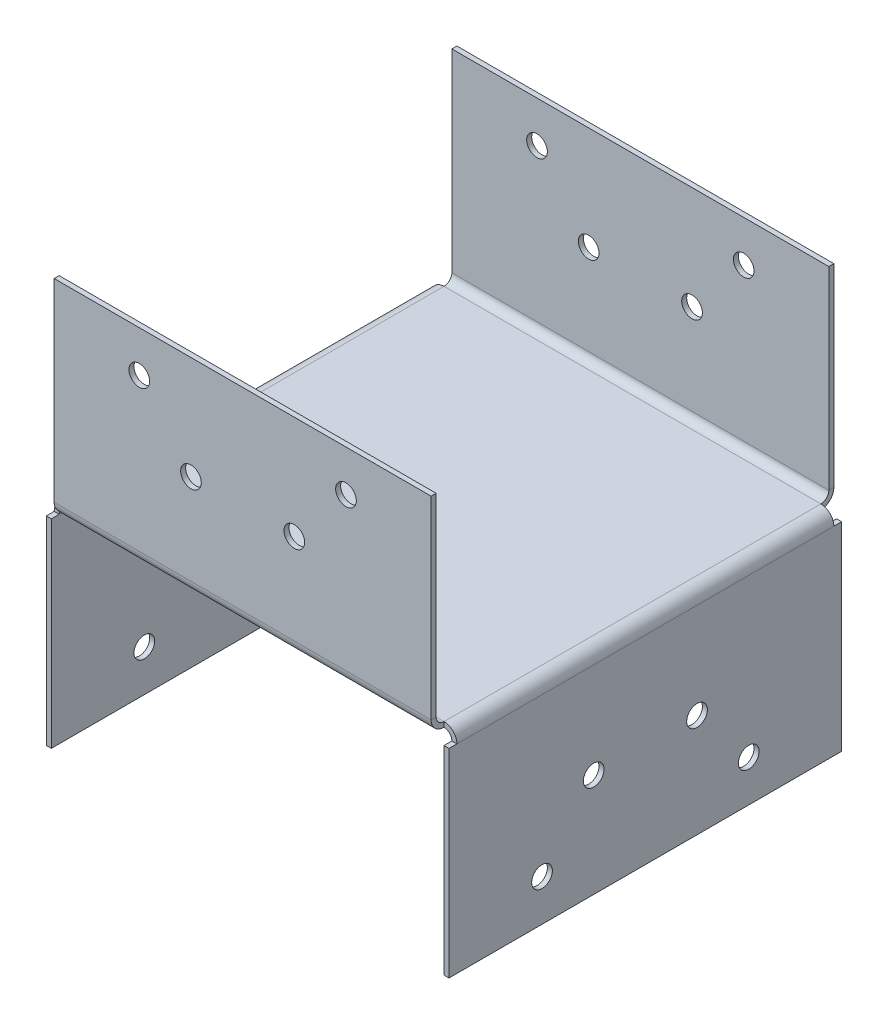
ISO-10303-21;
HEADER;
FILE_DESCRIPTION(('STEP AP214'),'2;1');
FILE_NAME('part.step','',(''),(''),'','','');
FILE_SCHEMA(('AUTOMOTIVE_DESIGN { 1 0 10303 214 1 1 1 1 }'));
ENDSEC;
DATA;
#1=APPLICATION_CONTEXT('core data for automotive mechanical design processes');
#2=APPLICATION_PROTOCOL_DEFINITION('international standard','automotive_design',2000,#1);
#3=PRODUCT_CONTEXT('',#1,'mechanical');
#4=PRODUCT('Part','Part','',(#3));
#5=PRODUCT_RELATED_PRODUCT_CATEGORY('part','',(#4));
#6=PRODUCT_DEFINITION_FORMATION('','',#4);
#7=PRODUCT_DEFINITION_CONTEXT('part definition',#1,'design');
#8=PRODUCT_DEFINITION('design','',#6,#7);
#9=PRODUCT_DEFINITION_SHAPE('','',#8);
#10=(LENGTH_UNIT() NAMED_UNIT(*) SI_UNIT(.MILLI.,.METRE.));
#11=(NAMED_UNIT(*) PLANE_ANGLE_UNIT() SI_UNIT($,.RADIAN.));
#12=(NAMED_UNIT(*) SI_UNIT($,.STERADIAN.) SOLID_ANGLE_UNIT());
#13=UNCERTAINTY_MEASURE_WITH_UNIT(LENGTH_MEASURE(1.E-05),#10,'distance_accuracy_value','');
#14=(GEOMETRIC_REPRESENTATION_CONTEXT(3) GLOBAL_UNCERTAINTY_ASSIGNED_CONTEXT((#13)) GLOBAL_UNIT_ASSIGNED_CONTEXT((#10,
#11,#12)) REPRESENTATION_CONTEXT('',''));
#15=CARTESIAN_POINT('',(0.,0.,0.));
#16=DIRECTION('',(0.,0.,1.));
#17=DIRECTION('',(1.,0.,0.));
#18=AXIS2_PLACEMENT_3D('',#15,#16,#17);
#19=CARTESIAN_POINT('',(0.,0.,48.71412));
#20=DIRECTION('',(0.,0.,-1.));
#21=DIRECTION('',(-1.,0.,0.));
#22=AXIS2_PLACEMENT_3D('',#19,#20,#21);
#23=PLANE('',#22);
#24=CARTESIAN_POINT('',(-12.5,25.,48.71412));
#25=DIRECTION('',(0.,0.,1.));
#26=DIRECTION('',(1.,0.,0.));
#27=AXIS2_PLACEMENT_3D('',#24,#25,#26);
#28=CIRCLE('',#27,2.49999999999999);
#29=CARTESIAN_POINT('',(-10.,25.,48.71412));
#30=VERTEX_POINT('',#29);
#31=EDGE_CURVE('E711',#30,#30,#28,.T.);
#32=ORIENTED_EDGE('',*,*,#31,.F.);
#33=EDGE_LOOP('',(#32));
#34=FACE_BOUND('',#33,.T.);
#35=CARTESIAN_POINT('',(12.5,25.,48.71412));
#36=DIRECTION('',(0.,0.,1.));
#37=DIRECTION('',(1.,0.,0.));
#38=AXIS2_PLACEMENT_3D('',#35,#36,#37);
#39=CIRCLE('',#38,2.49999999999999);
#40=CARTESIAN_POINT('',(15.,25.,48.71412));
#41=VERTEX_POINT('',#40);
#42=EDGE_CURVE('E447',#41,#41,#39,.T.);
#43=ORIENTED_EDGE('',*,*,#42,.F.);
#44=EDGE_LOOP('',(#43));
#45=FACE_BOUND('',#44,.T.);
#46=CARTESIAN_POINT('',(25.,40.,48.71412));
#47=DIRECTION('',(0.,0.,1.));
#48=DIRECTION('',(1.,0.,0.));
#49=AXIS2_PLACEMENT_3D('',#46,#47,#48);
#50=CIRCLE('',#49,2.49999999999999);
#51=CARTESIAN_POINT('',(27.5,40.,48.71412));
#52=VERTEX_POINT('',#51);
#53=EDGE_CURVE('E444',#52,#52,#50,.T.);
#54=ORIENTED_EDGE('',*,*,#53,.F.);
#55=EDGE_LOOP('',(#54));
#56=FACE_BOUND('',#55,.T.);
#57=DIRECTION('',(-1.,0.,0.));
#58=VECTOR('',#57,1.);
#59=CARTESIAN_POINT('',(0.,3.11911999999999,48.71412));
#60=LINE('',#59,#58);
#61=CARTESIAN_POINT('',(45.595,3.11911999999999,48.71412));
#62=VERTEX_POINT('',#61);
#63=CARTESIAN_POINT('',(-45.595,3.11911999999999,48.71412));
#64=VERTEX_POINT('',#63);
#65=EDGE_CURVE('E274',#62,#64,#60,.T.);
#66=ORIENTED_EDGE('',*,*,#65,.F.);
#67=DIRECTION('',(0.,1.,0.));
#68=VECTOR('',#67,1.);
#69=CARTESIAN_POINT('',(45.595,50.,48.71412));
#70=LINE('',#69,#68);
#71=CARTESIAN_POINT('',(45.595,50.,48.71412));
#72=VERTEX_POINT('',#71);
#73=EDGE_CURVE('E279',#62,#72,#70,.T.);
#74=ORIENTED_EDGE('',*,*,#73,.T.);
#75=DIRECTION('',(-1.,0.,0.));
#76=VECTOR('',#75,1.);
#77=CARTESIAN_POINT('',(-45.595,50.,48.71412));
#78=LINE('',#77,#76);
#79=CARTESIAN_POINT('',(-45.595,50.,48.71412));
#80=VERTEX_POINT('',#79);
#81=EDGE_CURVE('E281',#72,#80,#78,.T.);
#82=ORIENTED_EDGE('',*,*,#81,.T.);
#83=DIRECTION('',(0.,-1.,0.));
#84=VECTOR('',#83,1.);
#85=CARTESIAN_POINT('',(-45.595,1.21412,48.71412));
#86=LINE('',#85,#84);
#87=EDGE_CURVE('E284',#80,#64,#86,.T.);
#88=ORIENTED_EDGE('',*,*,#87,.T.);
#89=EDGE_LOOP('',(#66,#74,#82,#88));
#90=FACE_BOUND('',#89,.T.);
#91=CARTESIAN_POINT('',(-25.,40.,48.71412));
#92=DIRECTION('',(0.,0.,1.));
#93=DIRECTION('',(1.,0.,0.));
#94=AXIS2_PLACEMENT_3D('',#91,#92,#93);
#95=CIRCLE('',#94,2.49999999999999);
#96=CARTESIAN_POINT('',(-22.5,40.,48.71412));
#97=VERTEX_POINT('',#96);
#98=EDGE_CURVE('E693',#97,#97,#95,.T.);
#99=ORIENTED_EDGE('',*,*,#98,.F.);
#100=EDGE_LOOP('',(#99));
#101=FACE_BOUND('',#100,.T.);
#102=ADVANCED_FACE('F44',(#34,#45,#56,#90,#101),#23,.F.);
#103=CARTESIAN_POINT('',(0.,-1.90499999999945,0.));
#104=DIRECTION('',(0.,-1.,0.));
#105=DIRECTION('',(1.,0.,0.));
#106=AXIS2_PLACEMENT_3D('',#103,#104,#105);
#107=PLANE('',#106);
#108=DIRECTION('',(-1.,0.,0.));
#109=VECTOR('',#108,1.);
#110=CARTESIAN_POINT('',(-47.5,-1.905,-45.595));
#111=LINE('',#110,#109);
#112=CARTESIAN_POINT('',(-47.5,-1.905,-45.595));
#113=VERTEX_POINT('',#112);
#114=CARTESIAN_POINT('',(-48.71412,-1.90500000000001,-45.595));
#115=VERTEX_POINT('',#114);
#116=EDGE_CURVE('E12',#113,#115,#111,.T.);
#117=ORIENTED_EDGE('',*,*,#116,.F.);
#118=DIRECTION('',(0.,0.,-1.));
#119=VECTOR('',#118,1.);
#120=CARTESIAN_POINT('',(-47.5,-1.905,47.5));
#121=LINE('',#120,#119);
#122=CARTESIAN_POINT('',(-47.5,-1.905,-47.5));
#123=VERTEX_POINT('',#122);
#124=EDGE_CURVE('E387',#113,#123,#121,.T.);
#125=ORIENTED_EDGE('',*,*,#124,.T.);
#126=DIRECTION('',(1.,0.,0.));
#127=VECTOR('',#126,1.);
#128=CARTESIAN_POINT('',(-48.71412,-1.90500000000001,-47.5));
#129=LINE('',#128,#127);
#130=CARTESIAN_POINT('',(-48.71412,-1.90500000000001,-47.5));
#131=VERTEX_POINT('',#130);
#132=EDGE_CURVE('E401',#131,#123,#129,.T.);
#133=ORIENTED_EDGE('',*,*,#132,.F.);
#134=DIRECTION('',(0.,0.,-1.));
#135=VECTOR('',#134,1.);
#136=CARTESIAN_POINT('',(-48.71412,-1.90500000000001,47.5));
#137=LINE('',#136,#135);
#138=EDGE_CURVE('E340',#115,#131,#137,.T.);
#139=ORIENTED_EDGE('',*,*,#138,.F.);
#140=EDGE_LOOP('',(#117,#125,#133,#139));
#141=FACE_BOUND('',#140,.T.);
#142=ADVANCED_FACE('F46',(#141),#107,.F.);
#143=CARTESIAN_POINT('',(-45.595,-1.905,47.5));
#144=DIRECTION('',(0.,0.,-1.));
#145=DIRECTION('',(-1.,0.,0.));
#146=AXIS2_PLACEMENT_3D('',#143,#144,#145);
#147=CYLINDRICAL_SURFACE('',#146,1.905);
#148=CARTESIAN_POINT('',(-47.5,-1.905,45.595));
#149=VERTEX_POINT('',#148);
#150=EDGE_CURVE('E392',#149,#113,#121,.T.);
#151=ORIENTED_EDGE('',*,*,#150,.T.);
#152=CARTESIAN_POINT('',(-45.595,-1.905,-45.595));
#153=DIRECTION('',(0.,0.,-1.));
#154=DIRECTION('',(0.,1.,0.));
#155=AXIS2_PLACEMENT_3D('',#152,#153,#154);
#156=CIRCLE('',#155,1.905);
#157=CARTESIAN_POINT('',(-45.595,0.,-45.595));
#158=VERTEX_POINT('',#157);
#159=EDGE_CURVE('E430',#113,#158,#156,.T.);
#160=ORIENTED_EDGE('',*,*,#159,.T.);
#161=DIRECTION('',(0.,0.,-1.));
#162=VECTOR('',#161,1.);
#163=CARTESIAN_POINT('',(-45.595,0.,47.5));
#164=LINE('',#163,#162);
#165=CARTESIAN_POINT('',(-45.595,0.,45.595));
#166=VERTEX_POINT('',#165);
#167=EDGE_CURVE('E384',#166,#158,#164,.T.);
#168=ORIENTED_EDGE('',*,*,#167,.F.);
#169=CARTESIAN_POINT('',(-45.595,-1.905,45.595));
#170=DIRECTION('',(0.,0.,1.));
#171=DIRECTION('',(0.,-1.,0.));
#172=AXIS2_PLACEMENT_3D('',#169,#170,#171);
#173=CIRCLE('',#172,1.905);
#174=EDGE_CURVE('E409',#166,#149,#173,.T.);
#175=ORIENTED_EDGE('',*,*,#174,.T.);
#176=EDGE_LOOP('',(#151,#160,#168,#175));
#177=FACE_BOUND('',#176,.T.);
#178=ADVANCED_FACE('F501',(#177),#147,.F.);
#179=CARTESIAN_POINT('',(0.,-1.90500000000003,0.));
#180=DIRECTION('',(0.,-1.,0.));
#181=DIRECTION('',(1.,0.,0.));
#182=AXIS2_PLACEMENT_3D('',#179,#180,#181);
#183=PLANE('',#182);
#184=DIRECTION('',(-1.,0.,0.));
#185=VECTOR('',#184,1.);
#186=CARTESIAN_POINT('',(48.71412,-1.905,-45.595));
#187=LINE('',#186,#185);
#188=CARTESIAN_POINT('',(48.71412,-1.905,-45.595));
#189=VERTEX_POINT('',#188);
#190=CARTESIAN_POINT('',(47.5,-1.905,-45.595));
#191=VERTEX_POINT('',#190);
#192=EDGE_CURVE('E428',#189,#191,#187,.T.);
#193=ORIENTED_EDGE('',*,*,#192,.F.);
#194=DIRECTION('',(0.,0.,-1.));
#195=VECTOR('',#194,1.);
#196=CARTESIAN_POINT('',(48.71412,-1.905,47.5));
#197=LINE('',#196,#195);
#198=CARTESIAN_POINT('',(48.71412,-1.905,-47.5));
#199=VERTEX_POINT('',#198);
#200=EDGE_CURVE('E367',#189,#199,#197,.T.);
#201=ORIENTED_EDGE('',*,*,#200,.T.);
#202=DIRECTION('',(1.,0.,0.));
#203=VECTOR('',#202,1.);
#204=CARTESIAN_POINT('',(47.5,-1.905,-47.5));
#205=LINE('',#204,#203);
#206=CARTESIAN_POINT('',(47.5,-1.905,-47.5));
#207=VERTEX_POINT('',#206);
#208=EDGE_CURVE('E396',#207,#199,#205,.T.);
#209=ORIENTED_EDGE('',*,*,#208,.F.);
#210=DIRECTION('',(0.,0.,-1.));
#211=VECTOR('',#210,1.);
#212=CARTESIAN_POINT('',(47.5,-1.905,47.5));
#213=LINE('',#212,#211);
#214=EDGE_CURVE('E376',#191,#207,#213,.T.);
#215=ORIENTED_EDGE('',*,*,#214,.F.);
#216=EDGE_LOOP('',(#193,#201,#209,#215));
#217=FACE_BOUND('',#216,.T.);
#218=ADVANCED_FACE('F578',(#217),#183,.F.);
#219=CARTESIAN_POINT('',(45.595,-1.905,47.5));
#220=DIRECTION('',(0.,0.,-1.));
#221=DIRECTION('',(-1.,0.,0.));
#222=AXIS2_PLACEMENT_3D('',#219,#220,#221);
#223=CYLINDRICAL_SURFACE('',#222,1.905);
#224=DIRECTION('',(0.,0.,-1.));
#225=VECTOR('',#224,1.);
#226=CARTESIAN_POINT('',(45.595,0.,47.5));
#227=LINE('',#226,#225);
#228=CARTESIAN_POINT('',(45.595,0.,45.595));
#229=VERTEX_POINT('',#228);
#230=CARTESIAN_POINT('',(45.595,0.,-45.595));
#231=VERTEX_POINT('',#230);
#232=EDGE_CURVE('E380',#229,#231,#227,.T.);
#233=ORIENTED_EDGE('',*,*,#232,.T.);
#234=CARTESIAN_POINT('',(45.595,-1.905,-45.595));
#235=DIRECTION('',(0.,0.,-1.));
#236=DIRECTION('',(0.,1.,0.));
#237=AXIS2_PLACEMENT_3D('',#234,#235,#236);
#238=CIRCLE('',#237,1.905);
#239=EDGE_CURVE('E425',#231,#191,#238,.T.);
#240=ORIENTED_EDGE('',*,*,#239,.T.);
#241=CARTESIAN_POINT('',(47.5,-1.905,45.595));
#242=VERTEX_POINT('',#241);
#243=EDGE_CURVE('E381',#242,#191,#213,.T.);
#244=ORIENTED_EDGE('',*,*,#243,.F.);
#245=CARTESIAN_POINT('',(45.595,-1.905,45.595));
#246=DIRECTION('',(0.,0.,1.));
#247=DIRECTION('',(0.,-1.,0.));
#248=AXIS2_PLACEMENT_3D('',#245,#246,#247);
#249=CIRCLE('',#248,1.905);
#250=EDGE_CURVE('E414',#242,#229,#249,.T.);
#251=ORIENTED_EDGE('',*,*,#250,.T.);
#252=EDGE_LOOP('',(#233,#240,#244,#251));
#253=FACE_BOUND('',#252,.T.);
#254=ADVANCED_FACE('F574',(#253),#223,.F.);
#255=CARTESIAN_POINT('',(45.595,-1.905,-45.595));
#256=DIRECTION('',(0.,0.,-1.));
#257=DIRECTION('',(0.,1.,0.));
#258=AXIS2_PLACEMENT_3D('',#255,#256,#257);
#259=PLANE('',#258);
#260=CARTESIAN_POINT('',(45.595,-1.905,-45.595));
#261=DIRECTION('',(0.,0.,-1.));
#262=DIRECTION('',(0.,1.,0.));
#263=AXIS2_PLACEMENT_3D('',#260,#261,#262);
#264=CIRCLE('',#263,3.11912);
#265=CARTESIAN_POINT('',(45.595,1.21411999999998,-45.595));
#266=VERTEX_POINT('',#265);
#267=EDGE_CURVE('E422',#266,#189,#264,.T.);
#268=ORIENTED_EDGE('',*,*,#267,.T.);
#269=ORIENTED_EDGE('',*,*,#192,.T.);
#270=ORIENTED_EDGE('',*,*,#239,.F.);
#271=DIRECTION('',(0.,-1.,0.));
#272=VECTOR('',#271,1.);
#273=CARTESIAN_POINT('',(45.595,1.21411999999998,-45.595));
#274=LINE('',#273,#272);
#275=EDGE_CURVE('E263',#266,#231,#274,.T.);
#276=ORIENTED_EDGE('',*,*,#275,.F.);
#277=EDGE_LOOP('',(#268,#269,#270,#276));
#278=FACE_BOUND('',#277,.T.);
#279=ADVANCED_FACE('F577',(#278),#259,.T.);
#280=CARTESIAN_POINT('',(-47.5,0.,47.5));
#281=DIRECTION('',(0.,-1.,0.));
#282=DIRECTION('',(0.,0.,-1.));
#283=AXIS2_PLACEMENT_3D('',#280,#281,#282);
#284=PLANE('',#283);
#285=ORIENTED_EDGE('',*,*,#167,.T.);
#286=DIRECTION('',(-1.,0.,0.));
#287=VECTOR('',#286,1.);
#288=CARTESIAN_POINT('',(-45.595,0.,-45.595));
#289=LINE('',#288,#287);
#290=EDGE_CURVE('E210',#158,#231,#289,.F.);
#291=ORIENTED_EDGE('',*,*,#290,.T.);
#292=ORIENTED_EDGE('',*,*,#232,.F.);
#293=DIRECTION('',(1.,0.,0.));
#294=VECTOR('',#293,1.);
#295=CARTESIAN_POINT('',(45.595,0.,45.595));
#296=LINE('',#295,#294);
#297=EDGE_CURVE('E299',#229,#166,#296,.F.);
#298=ORIENTED_EDGE('',*,*,#297,.T.);
#299=EDGE_LOOP('',(#285,#291,#292,#298));
#300=FACE_BOUND('',#299,.T.);
#301=ADVANCED_FACE('F556',(#300),#284,.T.);
#302=CARTESIAN_POINT('',(-47.5,1.21412,47.5));
#303=DIRECTION('',(0.,-1.,0.));
#304=DIRECTION('',(0.,0.,-1.));
#305=AXIS2_PLACEMENT_3D('',#302,#303,#304);
#306=PLANE('',#305);
#307=DIRECTION('',(-1.,0.,0.));
#308=VECTOR('',#307,1.);
#309=CARTESIAN_POINT('',(-45.595,1.21411999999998,-45.595));
#310=LINE('',#309,#308);
#311=CARTESIAN_POINT('',(-45.595,1.21411999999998,-45.595));
#312=VERTEX_POINT('',#311);
#313=EDGE_CURVE('E260',#312,#266,#310,.F.);
#314=ORIENTED_EDGE('',*,*,#313,.F.);
#315=DIRECTION('',(0.,0.,-1.));
#316=VECTOR('',#315,1.);
#317=CARTESIAN_POINT('',(-45.595,1.21412,47.5));
#318=LINE('',#317,#316);
#319=CARTESIAN_POINT('',(-45.595,1.21412,45.595));
#320=VERTEX_POINT('',#319);
#321=EDGE_CURVE('E360',#320,#312,#318,.T.);
#322=ORIENTED_EDGE('',*,*,#321,.F.);
#323=DIRECTION('',(1.,0.,0.));
#324=VECTOR('',#323,1.);
#325=CARTESIAN_POINT('',(45.595,1.21412,45.595));
#326=LINE('',#325,#324);
#327=CARTESIAN_POINT('',(45.595,1.21412,45.595));
#328=VERTEX_POINT('',#327);
#329=EDGE_CURVE('E312',#328,#320,#326,.F.);
#330=ORIENTED_EDGE('',*,*,#329,.F.);
#331=DIRECTION('',(0.,0.,-1.));
#332=VECTOR('',#331,1.);
#333=CARTESIAN_POINT('',(45.595,1.21412,47.5));
#334=LINE('',#333,#332);
#335=EDGE_CURVE('E364',#328,#266,#334,.T.);
#336=ORIENTED_EDGE('',*,*,#335,.T.);
#337=EDGE_LOOP('',(#314,#322,#330,#336));
#338=FACE_BOUND('',#337,.T.);
#339=ADVANCED_FACE('F552',(#338),#306,.F.);
#340=CARTESIAN_POINT('',(0.,-1.90500000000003,0.));
#341=DIRECTION('',(0.,1.,0.));
#342=DIRECTION('',(-1.,0.,0.));
#343=AXIS2_PLACEMENT_3D('',#340,#341,#342);
#344=PLANE('',#343);
#345=DIRECTION('',(1.,0.,0.));
#346=VECTOR('',#345,1.);
#347=CARTESIAN_POINT('',(47.5,-1.905,45.595));
#348=LINE('',#347,#346);
#349=CARTESIAN_POINT('',(48.71412,-1.905,45.595));
#350=VERTEX_POINT('',#349);
#351=EDGE_CURVE('E420',#242,#350,#348,.T.);
#352=ORIENTED_EDGE('',*,*,#351,.F.);
#353=CARTESIAN_POINT('',(47.5,-1.905,47.5));
#354=VERTEX_POINT('',#353);
#355=EDGE_CURVE('E377',#354,#242,#213,.T.);
#356=ORIENTED_EDGE('',*,*,#355,.F.);
#357=DIRECTION('',(-1.,0.,0.));
#358=VECTOR('',#357,1.);
#359=CARTESIAN_POINT('',(48.71412,-1.905,47.5));
#360=LINE('',#359,#358);
#361=CARTESIAN_POINT('',(48.71412,-1.905,47.5));
#362=VERTEX_POINT('',#361);
#363=EDGE_CURVE('E399',#362,#354,#360,.T.);
#364=ORIENTED_EDGE('',*,*,#363,.F.);
#365=EDGE_CURVE('E368',#362,#350,#197,.T.);
#366=ORIENTED_EDGE('',*,*,#365,.T.);
#367=EDGE_LOOP('',(#352,#356,#364,#366));
#368=FACE_BOUND('',#367,.T.);
#369=ADVANCED_FACE('F555',(#368),#344,.T.);
#370=CARTESIAN_POINT('',(0.,-1.90499999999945,0.));
#371=DIRECTION('',(0.,1.,0.));
#372=DIRECTION('',(-1.,0.,0.));
#373=AXIS2_PLACEMENT_3D('',#370,#371,#372);
#374=PLANE('',#373);
#375=DIRECTION('',(1.,0.,0.));
#376=VECTOR('',#375,1.);
#377=CARTESIAN_POINT('',(-48.71412,-1.90500000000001,45.595));
#378=LINE('',#377,#376);
#379=CARTESIAN_POINT('',(-48.71412,-1.90500000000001,45.595));
#380=VERTEX_POINT('',#379);
#381=EDGE_CURVE('E412',#380,#149,#378,.T.);
#382=ORIENTED_EDGE('',*,*,#381,.F.);
#383=CARTESIAN_POINT('',(-48.71412,-1.90500000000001,47.5));
#384=VERTEX_POINT('',#383);
#385=EDGE_CURVE('E357',#384,#380,#137,.T.);
#386=ORIENTED_EDGE('',*,*,#385,.F.);
#387=DIRECTION('',(-1.,0.,0.));
#388=VECTOR('',#387,1.);
#389=CARTESIAN_POINT('',(-47.5,-1.905,47.5));
#390=LINE('',#389,#388);
#391=CARTESIAN_POINT('',(-47.5,-1.905,47.5));
#392=VERTEX_POINT('',#391);
#393=EDGE_CURVE('E404',#392,#384,#390,.T.);
#394=ORIENTED_EDGE('',*,*,#393,.F.);
#395=EDGE_CURVE('E388',#392,#149,#121,.T.);
#396=ORIENTED_EDGE('',*,*,#395,.T.);
#397=EDGE_LOOP('',(#382,#386,#394,#396));
#398=FACE_BOUND('',#397,.T.);
#399=ADVANCED_FACE('F611',(#398),#374,.T.);
#400=CARTESIAN_POINT('',(-45.595,-1.905,-45.595));
#401=DIRECTION('',(0.,0.,-1.));
#402=DIRECTION('',(0.,1.,0.));
#403=AXIS2_PLACEMENT_3D('',#400,#401,#402);
#404=PLANE('',#403);
#405=ORIENTED_EDGE('',*,*,#159,.F.);
#406=ORIENTED_EDGE('',*,*,#116,.T.);
#407=CARTESIAN_POINT('',(-45.595,-1.905,-45.595));
#408=DIRECTION('',(0.,0.,-1.));
#409=DIRECTION('',(0.,1.,0.));
#410=AXIS2_PLACEMENT_3D('',#407,#408,#409);
#411=CIRCLE('',#410,3.11912);
#412=EDGE_CURVE('E53',#115,#312,#411,.T.);
#413=ORIENTED_EDGE('',*,*,#412,.T.);
#414=DIRECTION('',(0.,-1.,0.));
#415=VECTOR('',#414,1.);
#416=CARTESIAN_POINT('',(-45.595,1.21411999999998,-45.595));
#417=LINE('',#416,#415);
#418=EDGE_CURVE('E256',#312,#158,#417,.T.);
#419=ORIENTED_EDGE('',*,*,#418,.T.);
#420=EDGE_LOOP('',(#405,#406,#413,#419));
#421=FACE_BOUND('',#420,.T.);
#422=ADVANCED_FACE('F609',(#421),#404,.T.);
#423=CARTESIAN_POINT('',(-45.595,-1.905,45.595));
#424=DIRECTION('',(0.,0.,1.));
#425=DIRECTION('',(0.,-1.,0.));
#426=AXIS2_PLACEMENT_3D('',#423,#424,#425);
#427=PLANE('',#426);
#428=CARTESIAN_POINT('',(-45.595,-1.905,45.595));
#429=DIRECTION('',(0.,0.,1.));
#430=DIRECTION('',(0.,-1.,0.));
#431=AXIS2_PLACEMENT_3D('',#428,#429,#430);
#432=CIRCLE('',#431,3.11912);
#433=EDGE_CURVE('E406',#320,#380,#432,.T.);
#434=ORIENTED_EDGE('',*,*,#433,.T.);
#435=ORIENTED_EDGE('',*,*,#381,.T.);
#436=ORIENTED_EDGE('',*,*,#174,.F.);
#437=DIRECTION('',(0.,-1.,0.));
#438=VECTOR('',#437,1.);
#439=CARTESIAN_POINT('',(-45.595,1.21412,45.595));
#440=LINE('',#439,#438);
#441=EDGE_CURVE('E316',#320,#166,#440,.T.);
#442=ORIENTED_EDGE('',*,*,#441,.F.);
#443=EDGE_LOOP('',(#434,#435,#436,#442));
#444=FACE_BOUND('',#443,.T.);
#445=ADVANCED_FACE('F605',(#444),#427,.T.);
#446=CARTESIAN_POINT('',(-45.595,1.21412,47.5));
#447=DIRECTION('',(0.,0.,1.));
#448=DIRECTION('',(1.,0.,0.));
#449=AXIS2_PLACEMENT_3D('',#446,#447,#448);
#450=PLANE('',#449);
#451=DIRECTION('',(0.,-1.,0.));
#452=VECTOR('',#451,1.);
#453=CARTESIAN_POINT('',(-47.5,-50.,47.5));
#454=LINE('',#453,#452);
#455=CARTESIAN_POINT('',(-47.5,-50.,47.5));
#456=VERTEX_POINT('',#455);
#457=EDGE_CURVE('E328',#392,#456,#454,.T.);
#458=ORIENTED_EDGE('',*,*,#457,.F.);
#459=ORIENTED_EDGE('',*,*,#393,.T.);
#460=DIRECTION('',(0.,1.,0.));
#461=VECTOR('',#460,1.);
#462=CARTESIAN_POINT('',(-48.71412,-50.,47.5));
#463=LINE('',#462,#461);
#464=CARTESIAN_POINT('',(-48.71412,-50.,47.5));
#465=VERTEX_POINT('',#464);
#466=EDGE_CURVE('E322',#384,#465,#463,.F.);
#467=ORIENTED_EDGE('',*,*,#466,.T.);
#468=DIRECTION('',(-1.,0.,0.));
#469=VECTOR('',#468,1.);
#470=CARTESIAN_POINT('',(-47.5,-50.,47.5));
#471=LINE('',#470,#469);
#472=EDGE_CURVE('E324',#456,#465,#471,.T.);
#473=ORIENTED_EDGE('',*,*,#472,.F.);
#474=EDGE_LOOP('',(#458,#459,#467,#473));
#475=FACE_BOUND('',#474,.T.);
#476=ADVANCED_FACE('F601',(#475),#450,.T.);
#477=CARTESIAN_POINT('',(45.595,1.21412,-47.5));
#478=DIRECTION('',(0.,0.,-1.));
#479=DIRECTION('',(-1.,0.,0.));
#480=AXIS2_PLACEMENT_3D('',#477,#478,#479);
#481=PLANE('',#480);
#482=DIRECTION('',(0.,1.,0.));
#483=VECTOR('',#482,1.);
#484=CARTESIAN_POINT('',(47.5,-50.,-47.5));
#485=LINE('',#484,#483);
#486=CARTESIAN_POINT('',(47.5,-50.,-47.5));
#487=VERTEX_POINT('',#486);
#488=EDGE_CURVE('E349',#487,#207,#485,.T.);
#489=ORIENTED_EDGE('',*,*,#488,.T.);
#490=ORIENTED_EDGE('',*,*,#208,.T.);
#491=DIRECTION('',(0.,1.,0.));
#492=VECTOR('',#491,1.);
#493=CARTESIAN_POINT('',(48.71412,-50.,-47.5));
#494=LINE('',#493,#492);
#495=CARTESIAN_POINT('',(48.71412,-50.,-47.5));
#496=VERTEX_POINT('',#495);
#497=EDGE_CURVE('E325',#496,#199,#494,.T.);
#498=ORIENTED_EDGE('',*,*,#497,.F.);
#499=DIRECTION('',(-1.,0.,0.));
#500=VECTOR('',#499,1.);
#501=CARTESIAN_POINT('',(48.71412,-50.,-47.5));
#502=LINE('',#501,#500);
#503=EDGE_CURVE('E352',#496,#487,#502,.T.);
#504=ORIENTED_EDGE('',*,*,#503,.T.);
#505=EDGE_LOOP('',(#489,#490,#498,#504));
#506=FACE_BOUND('',#505,.T.);
#507=ADVANCED_FACE('F597',(#506),#481,.T.);
#508=CARTESIAN_POINT('',(-48.71412,-50.,47.5));
#509=DIRECTION('',(1.,0.,0.));
#510=DIRECTION('',(0.,0.,-1.));
#511=AXIS2_PLACEMENT_3D('',#508,#509,#510);
#512=PLANE('',#511);
#513=CARTESIAN_POINT('',(-48.71412,-40.,25.));
#514=DIRECTION('',(1.,0.,0.));
#515=DIRECTION('',(0.,0.,-1.));
#516=AXIS2_PLACEMENT_3D('',#513,#514,#515);
#517=CIRCLE('',#516,2.49999999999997);
#518=CARTESIAN_POINT('',(-48.71412,-40.,22.5));
#519=VERTEX_POINT('',#518);
#520=EDGE_CURVE('E781',#519,#519,#517,.T.);
#521=ORIENTED_EDGE('',*,*,#520,.T.);
#522=EDGE_LOOP('',(#521));
#523=FACE_BOUND('',#522,.T.);
#524=CARTESIAN_POINT('',(-48.71412,-40.,-25.));
#525=DIRECTION('',(1.,0.,0.));
#526=DIRECTION('',(0.,0.,-1.));
#527=AXIS2_PLACEMENT_3D('',#524,#525,#526);
#528=CIRCLE('',#527,2.49999999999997);
#529=CARTESIAN_POINT('',(-48.71412,-40.,-27.5));
#530=VERTEX_POINT('',#529);
#531=EDGE_CURVE('E793',#530,#530,#528,.T.);
#532=ORIENTED_EDGE('',*,*,#531,.T.);
#533=EDGE_LOOP('',(#532));
#534=FACE_BOUND('',#533,.T.);
#535=CARTESIAN_POINT('',(-48.71412,-25.,-12.5));
#536=DIRECTION('',(1.,0.,0.));
#537=DIRECTION('',(0.,0.,-1.));
#538=AXIS2_PLACEMENT_3D('',#535,#536,#537);
#539=CIRCLE('',#538,2.49999999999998);
#540=CARTESIAN_POINT('',(-48.71412,-25.,-15.));
#541=VERTEX_POINT('',#540);
#542=EDGE_CURVE('E805',#541,#541,#539,.T.);
#543=ORIENTED_EDGE('',*,*,#542,.T.);
#544=EDGE_LOOP('',(#543));
#545=FACE_BOUND('',#544,.T.);
#546=CARTESIAN_POINT('',(-48.71412,-25.,12.5));
#547=DIRECTION('',(1.,0.,0.));
#548=DIRECTION('',(0.,0.,-1.));
#549=AXIS2_PLACEMENT_3D('',#546,#547,#548);
#550=CIRCLE('',#549,2.49999999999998);
#551=CARTESIAN_POINT('',(-48.71412,-25.,10.));
#552=VERTEX_POINT('',#551);
#553=EDGE_CURVE('E817',#552,#552,#550,.T.);
#554=ORIENTED_EDGE('',*,*,#553,.T.);
#555=EDGE_LOOP('',(#554));
#556=FACE_BOUND('',#555,.T.);
#557=DIRECTION('',(0.,1.,0.));
#558=VECTOR('',#557,1.);
#559=CARTESIAN_POINT('',(-48.71412,-50.,-47.5));
#560=LINE('',#559,#558);
#561=CARTESIAN_POINT('',(-48.71412,-50.,-47.5));
#562=VERTEX_POINT('',#561);
#563=EDGE_CURVE('E319',#131,#562,#560,.F.);
#564=ORIENTED_EDGE('',*,*,#563,.T.);
#565=DIRECTION('',(0.,0.,-1.));
#566=VECTOR('',#565,1.);
#567=CARTESIAN_POINT('',(-48.71412,-50.,47.5));
#568=LINE('',#567,#566);
#569=EDGE_CURVE('E394',#465,#562,#568,.T.);
#570=ORIENTED_EDGE('',*,*,#569,.F.);
#571=ORIENTED_EDGE('',*,*,#466,.F.);
#572=ORIENTED_EDGE('',*,*,#385,.T.);
#573=EDGE_CURVE('E361',#380,#115,#137,.T.);
#574=ORIENTED_EDGE('',*,*,#573,.T.);
#575=ORIENTED_EDGE('',*,*,#138,.T.);
#576=EDGE_LOOP('',(#564,#570,#571,#572,#574,#575));
#577=FACE_BOUND('',#576,.T.);
#578=ADVANCED_FACE('F593',(#523,#534,#545,#556,#577),#512,.F.);
#579=CARTESIAN_POINT('',(-47.5,-50.,47.5));
#580=DIRECTION('',(0.,-1.,0.));
#581=DIRECTION('',(0.,0.,-1.));
#582=AXIS2_PLACEMENT_3D('',#579,#580,#581);
#583=PLANE('',#582);
#584=DIRECTION('',(-1.,0.,0.));
#585=VECTOR('',#584,1.);
#586=CARTESIAN_POINT('',(-47.5,-50.,-47.5));
#587=LINE('',#586,#585);
#588=CARTESIAN_POINT('',(-47.5,-50.,-47.5));
#589=VERTEX_POINT('',#588);
#590=EDGE_CURVE('E343',#589,#562,#587,.T.);
#591=ORIENTED_EDGE('',*,*,#590,.F.);
#592=DIRECTION('',(0.,0.,-1.));
#593=VECTOR('',#592,1.);
#594=CARTESIAN_POINT('',(-47.5,-50.,47.5));
#595=LINE('',#594,#593);
#596=EDGE_CURVE('E391',#456,#589,#595,.T.);
#597=ORIENTED_EDGE('',*,*,#596,.F.);
#598=ORIENTED_EDGE('',*,*,#472,.T.);
#599=ORIENTED_EDGE('',*,*,#569,.T.);
#600=EDGE_LOOP('',(#591,#597,#598,#599));
#601=FACE_BOUND('',#600,.T.);
#602=ADVANCED_FACE('F589',(#601),#583,.T.);
#603=CARTESIAN_POINT('',(-47.5,-50.,47.5));
#604=DIRECTION('',(1.,0.,0.));
#605=DIRECTION('',(0.,0.,-1.));
#606=AXIS2_PLACEMENT_3D('',#603,#604,#605);
#607=PLANE('',#606);
#608=CARTESIAN_POINT('',(-47.5,-40.,25.));
#609=DIRECTION('',(1.,0.,0.));
#610=DIRECTION('',(0.,0.,-1.));
#611=AXIS2_PLACEMENT_3D('',#608,#609,#610);
#612=CIRCLE('',#611,2.49999999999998);
#613=CARTESIAN_POINT('',(-47.5,-40.,22.5));
#614=VERTEX_POINT('',#613);
#615=EDGE_CURVE('E787',#614,#614,#612,.T.);
#616=ORIENTED_EDGE('',*,*,#615,.F.);
#617=EDGE_LOOP('',(#616));
#618=FACE_BOUND('',#617,.T.);
#619=CARTESIAN_POINT('',(-47.5,-40.,-25.));
#620=DIRECTION('',(1.,0.,0.));
#621=DIRECTION('',(0.,0.,-1.));
#622=AXIS2_PLACEMENT_3D('',#619,#620,#621);
#623=CIRCLE('',#622,2.49999999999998);
#624=CARTESIAN_POINT('',(-47.5,-40.,-27.5));
#625=VERTEX_POINT('',#624);
#626=EDGE_CURVE('E796',#625,#625,#623,.T.);
#627=ORIENTED_EDGE('',*,*,#626,.F.);
#628=EDGE_LOOP('',(#627));
#629=FACE_BOUND('',#628,.T.);
#630=CARTESIAN_POINT('',(-47.5,-25.,-12.5));
#631=DIRECTION('',(1.,0.,0.));
#632=DIRECTION('',(0.,0.,-1.));
#633=AXIS2_PLACEMENT_3D('',#630,#631,#632);
#634=CIRCLE('',#633,2.49999999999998);
#635=CARTESIAN_POINT('',(-47.5,-25.,-15.));
#636=VERTEX_POINT('',#635);
#637=EDGE_CURVE('E808',#636,#636,#634,.T.);
#638=ORIENTED_EDGE('',*,*,#637,.F.);
#639=EDGE_LOOP('',(#638));
#640=FACE_BOUND('',#639,.T.);
#641=CARTESIAN_POINT('',(-47.5,-25.,12.5));
#642=DIRECTION('',(1.,0.,0.));
#643=DIRECTION('',(0.,0.,-1.));
#644=AXIS2_PLACEMENT_3D('',#641,#642,#643);
#645=CIRCLE('',#644,2.49999999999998);
#646=CARTESIAN_POINT('',(-47.5,-25.,10.));
#647=VERTEX_POINT('',#646);
#648=EDGE_CURVE('E702',#647,#647,#645,.T.);
#649=ORIENTED_EDGE('',*,*,#648,.F.);
#650=EDGE_LOOP('',(#649));
#651=FACE_BOUND('',#650,.T.);
#652=DIRECTION('',(0.,-1.,0.));
#653=VECTOR('',#652,1.);
#654=CARTESIAN_POINT('',(-47.5,-50.,-47.5));
#655=LINE('',#654,#653);
#656=EDGE_CURVE('E346',#123,#589,#655,.T.);
#657=ORIENTED_EDGE('',*,*,#656,.F.);
#658=ORIENTED_EDGE('',*,*,#124,.F.);
#659=ORIENTED_EDGE('',*,*,#150,.F.);
#660=ORIENTED_EDGE('',*,*,#395,.F.);
#661=ORIENTED_EDGE('',*,*,#457,.T.);
#662=ORIENTED_EDGE('',*,*,#596,.T.);
#663=EDGE_LOOP('',(#657,#658,#659,#660,#661,#662));
#664=FACE_BOUND('',#663,.T.);
#665=ADVANCED_FACE('F586',(#618,#629,#640,#651,#664),#607,.T.);
#666=CARTESIAN_POINT('',(45.595,-1.905,45.595));
#667=DIRECTION('',(0.,0.,1.));
#668=DIRECTION('',(0.,-1.,0.));
#669=AXIS2_PLACEMENT_3D('',#666,#667,#668);
#670=PLANE('',#669);
#671=ORIENTED_EDGE('',*,*,#250,.F.);
#672=ORIENTED_EDGE('',*,*,#351,.T.);
#673=CARTESIAN_POINT('',(45.595,-1.905,45.595));
#674=DIRECTION('',(0.,0.,1.));
#675=DIRECTION('',(0.,-1.,0.));
#676=AXIS2_PLACEMENT_3D('',#673,#674,#675);
#677=CIRCLE('',#676,3.11912);
#678=EDGE_CURVE('E417',#350,#328,#677,.T.);
#679=ORIENTED_EDGE('',*,*,#678,.T.);
#680=DIRECTION('',(0.,-1.,0.));
#681=VECTOR('',#680,1.);
#682=CARTESIAN_POINT('',(45.595,1.21412,45.595));
#683=LINE('',#682,#681);
#684=EDGE_CURVE('E306',#328,#229,#683,.T.);
#685=ORIENTED_EDGE('',*,*,#684,.T.);
#686=EDGE_LOOP('',(#671,#672,#679,#685));
#687=FACE_BOUND('',#686,.T.);
#688=ADVANCED_FACE('F572',(#687),#670,.T.);
#689=CARTESIAN_POINT('',(47.5,-50.,47.5));
#690=DIRECTION('',(-1.,0.,0.));
#691=DIRECTION('',(0.,0.,1.));
#692=AXIS2_PLACEMENT_3D('',#689,#690,#691);
#693=PLANE('',#692);
#694=CARTESIAN_POINT('',(47.5,-40.,25.));
#695=DIRECTION('',(-1.,0.,0.));
#696=DIRECTION('',(0.,0.,1.));
#697=AXIS2_PLACEMENT_3D('',#694,#695,#696);
#698=CIRCLE('',#697,2.49999999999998);
#699=CARTESIAN_POINT('',(47.5,-40.,27.5));
#700=VERTEX_POINT('',#699);
#701=EDGE_CURVE('E777',#700,#700,#698,.T.);
#702=ORIENTED_EDGE('',*,*,#701,.F.);
#703=EDGE_LOOP('',(#702));
#704=FACE_BOUND('',#703,.T.);
#705=CARTESIAN_POINT('',(47.5,-40.,-25.));
#706=DIRECTION('',(-1.,0.,0.));
#707=DIRECTION('',(0.,0.,1.));
#708=AXIS2_PLACEMENT_3D('',#705,#706,#707);
#709=CIRCLE('',#708,2.49999999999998);
#710=CARTESIAN_POINT('',(47.5,-40.,-22.5));
#711=VERTEX_POINT('',#710);
#712=EDGE_CURVE('E799',#711,#711,#709,.T.);
#713=ORIENTED_EDGE('',*,*,#712,.F.);
#714=EDGE_LOOP('',(#713));
#715=FACE_BOUND('',#714,.T.);
#716=CARTESIAN_POINT('',(47.5,-25.,-12.5));
#717=DIRECTION('',(-1.,0.,0.));
#718=DIRECTION('',(0.,0.,1.));
#719=AXIS2_PLACEMENT_3D('',#716,#717,#718);
#720=CIRCLE('',#719,2.49999999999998);
#721=CARTESIAN_POINT('',(47.5,-25.,-10.));
#722=VERTEX_POINT('',#721);
#723=EDGE_CURVE('E811',#722,#722,#720,.T.);
#724=ORIENTED_EDGE('',*,*,#723,.F.);
#725=EDGE_LOOP('',(#724));
#726=FACE_BOUND('',#725,.T.);
#727=CARTESIAN_POINT('',(47.5,-25.,12.5));
#728=DIRECTION('',(-1.,0.,0.));
#729=DIRECTION('',(0.,0.,1.));
#730=AXIS2_PLACEMENT_3D('',#727,#728,#729);
#731=CIRCLE('',#730,2.49999999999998);
#732=CARTESIAN_POINT('',(47.5,-25.,15.));
#733=VERTEX_POINT('',#732);
#734=EDGE_CURVE('E696',#733,#733,#731,.T.);
#735=ORIENTED_EDGE('',*,*,#734,.F.);
#736=EDGE_LOOP('',(#735));
#737=FACE_BOUND('',#736,.T.);
#738=ORIENTED_EDGE('',*,*,#488,.F.);
#739=DIRECTION('',(0.,0.,-1.));
#740=VECTOR('',#739,1.);
#741=CARTESIAN_POINT('',(47.5,-50.,47.5));
#742=LINE('',#741,#740);
#743=CARTESIAN_POINT('',(47.5,-50.,47.5));
#744=VERTEX_POINT('',#743);
#745=EDGE_CURVE('E374',#744,#487,#742,.T.);
#746=ORIENTED_EDGE('',*,*,#745,.F.);
#747=DIRECTION('',(0.,1.,0.));
#748=VECTOR('',#747,1.);
#749=CARTESIAN_POINT('',(47.5,-50.,47.5));
#750=LINE('',#749,#748);
#751=EDGE_CURVE('E331',#744,#354,#750,.T.);
#752=ORIENTED_EDGE('',*,*,#751,.T.);
#753=ORIENTED_EDGE('',*,*,#355,.T.);
#754=ORIENTED_EDGE('',*,*,#243,.T.);
#755=ORIENTED_EDGE('',*,*,#214,.T.);
#756=EDGE_LOOP('',(#738,#746,#752,#753,#754,#755));
#757=FACE_BOUND('',#756,.T.);
#758=ADVANCED_FACE('F568',(#704,#715,#726,#737,#757),#693,.T.);
#759=CARTESIAN_POINT('',(48.71412,-50.,47.5));
#760=DIRECTION('',(0.,-1.,0.));
#761=DIRECTION('',(0.,0.,-1.));
#762=AXIS2_PLACEMENT_3D('',#759,#760,#761);
#763=PLANE('',#762);
#764=ORIENTED_EDGE('',*,*,#503,.F.);
#765=DIRECTION('',(0.,0.,-1.));
#766=VECTOR('',#765,1.);
#767=CARTESIAN_POINT('',(48.71412,-50.,47.5));
#768=LINE('',#767,#766);
#769=CARTESIAN_POINT('',(48.71412,-50.,47.5));
#770=VERTEX_POINT('',#769);
#771=EDGE_CURVE('E371',#770,#496,#768,.T.);
#772=ORIENTED_EDGE('',*,*,#771,.F.);
#773=DIRECTION('',(-1.,0.,0.));
#774=VECTOR('',#773,1.);
#775=CARTESIAN_POINT('',(48.71412,-50.,47.5));
#776=LINE('',#775,#774);
#777=EDGE_CURVE('E334',#770,#744,#776,.T.);
#778=ORIENTED_EDGE('',*,*,#777,.T.);
#779=ORIENTED_EDGE('',*,*,#745,.T.);
#780=EDGE_LOOP('',(#764,#772,#778,#779));
#781=FACE_BOUND('',#780,.T.);
#782=ADVANCED_FACE('F564',(#781),#763,.T.);
#783=CARTESIAN_POINT('',(48.71412,-50.,47.5));
#784=DIRECTION('',(-1.,0.,0.));
#785=DIRECTION('',(0.,0.,1.));
#786=AXIS2_PLACEMENT_3D('',#783,#784,#785);
#787=PLANE('',#786);
#788=CARTESIAN_POINT('',(48.71412,-40.,25.));
#789=DIRECTION('',(1.,0.,0.));
#790=DIRECTION('',(0.,0.,-1.));
#791=AXIS2_PLACEMENT_3D('',#788,#789,#790);
#792=CIRCLE('',#791,2.49999999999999);
#793=CARTESIAN_POINT('',(48.71412,-40.,22.5));
#794=VERTEX_POINT('',#793);
#795=EDGE_CURVE('E780',#794,#794,#792,.T.);
#796=ORIENTED_EDGE('',*,*,#795,.F.);
#797=EDGE_LOOP('',(#796));
#798=FACE_BOUND('',#797,.T.);
#799=CARTESIAN_POINT('',(48.71412,-40.,-25.));
#800=DIRECTION('',(1.,0.,0.));
#801=DIRECTION('',(0.,0.,-1.));
#802=AXIS2_PLACEMENT_3D('',#799,#800,#801);
#803=CIRCLE('',#802,2.49999999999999);
#804=CARTESIAN_POINT('',(48.71412,-40.,-27.5));
#805=VERTEX_POINT('',#804);
#806=EDGE_CURVE('E790',#805,#805,#803,.T.);
#807=ORIENTED_EDGE('',*,*,#806,.F.);
#808=EDGE_LOOP('',(#807));
#809=FACE_BOUND('',#808,.T.);
#810=CARTESIAN_POINT('',(48.71412,-25.,-12.5));
#811=DIRECTION('',(1.,0.,0.));
#812=DIRECTION('',(0.,0.,-1.));
#813=AXIS2_PLACEMENT_3D('',#810,#811,#812);
#814=CIRCLE('',#813,2.49999999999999);
#815=CARTESIAN_POINT('',(48.71412,-25.,-15.));
#816=VERTEX_POINT('',#815);
#817=EDGE_CURVE('E802',#816,#816,#814,.T.);
#818=ORIENTED_EDGE('',*,*,#817,.F.);
#819=EDGE_LOOP('',(#818));
#820=FACE_BOUND('',#819,.T.);
#821=CARTESIAN_POINT('',(48.71412,-25.,12.5));
#822=DIRECTION('',(1.,0.,0.));
#823=DIRECTION('',(0.,0.,-1.));
#824=AXIS2_PLACEMENT_3D('',#821,#822,#823);
#825=CIRCLE('',#824,2.49999999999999);
#826=CARTESIAN_POINT('',(48.71412,-25.,10.));
#827=VERTEX_POINT('',#826);
#828=EDGE_CURVE('E814',#827,#827,#825,.T.);
#829=ORIENTED_EDGE('',*,*,#828,.F.);
#830=EDGE_LOOP('',(#829));
#831=FACE_BOUND('',#830,.T.);
#832=ORIENTED_EDGE('',*,*,#497,.T.);
#833=ORIENTED_EDGE('',*,*,#200,.F.);
#834=EDGE_CURVE('E372',#350,#189,#197,.T.);
#835=ORIENTED_EDGE('',*,*,#834,.F.);
#836=ORIENTED_EDGE('',*,*,#365,.F.);
#837=DIRECTION('',(0.,1.,0.));
#838=VECTOR('',#837,1.);
#839=CARTESIAN_POINT('',(48.71412,-50.,47.5));
#840=LINE('',#839,#838);
#841=EDGE_CURVE('E337',#770,#362,#840,.T.);
#842=ORIENTED_EDGE('',*,*,#841,.F.);
#843=ORIENTED_EDGE('',*,*,#771,.T.);
#844=EDGE_LOOP('',(#832,#833,#835,#836,#842,#843));
#845=FACE_BOUND('',#844,.T.);
#846=ADVANCED_FACE('F560',(#798,#809,#820,#831,#845),#787,.F.);
#847=CARTESIAN_POINT('',(45.595,-1.905,47.5));
#848=DIRECTION('',(0.,0.,-1.));
#849=DIRECTION('',(-1.,0.,0.));
#850=AXIS2_PLACEMENT_3D('',#847,#848,#849);
#851=CYLINDRICAL_SURFACE('',#850,3.11912);
#852=ORIENTED_EDGE('',*,*,#267,.F.);
#853=ORIENTED_EDGE('',*,*,#335,.F.);
#854=ORIENTED_EDGE('',*,*,#678,.F.);
#855=ORIENTED_EDGE('',*,*,#834,.T.);
#856=EDGE_LOOP('',(#852,#853,#854,#855));
#857=FACE_BOUND('',#856,.T.);
#858=ADVANCED_FACE('F550',(#857),#851,.T.);
#859=CARTESIAN_POINT('',(-45.595,-1.905,47.5));
#860=DIRECTION('',(0.,0.,-1.));
#861=DIRECTION('',(-1.,0.,0.));
#862=AXIS2_PLACEMENT_3D('',#859,#860,#861);
#863=CYLINDRICAL_SURFACE('',#862,3.11912);
#864=ORIENTED_EDGE('',*,*,#412,.F.);
#865=ORIENTED_EDGE('',*,*,#573,.F.);
#866=ORIENTED_EDGE('',*,*,#433,.F.);
#867=ORIENTED_EDGE('',*,*,#321,.T.);
#868=EDGE_LOOP('',(#864,#865,#866,#867));
#869=FACE_BOUND('',#868,.T.);
#870=ADVANCED_FACE('F543',(#869),#863,.T.);
#871=CARTESIAN_POINT('',(-45.595,-1.905,47.5));
#872=DIRECTION('',(0.,0.,1.));
#873=DIRECTION('',(1.,0.,0.));
#874=AXIS2_PLACEMENT_3D('',#871,#872,#873);
#875=PLANE('',#874);
#876=ORIENTED_EDGE('',*,*,#841,.T.);
#877=ORIENTED_EDGE('',*,*,#363,.T.);
#878=ORIENTED_EDGE('',*,*,#751,.F.);
#879=ORIENTED_EDGE('',*,*,#777,.F.);
#880=EDGE_LOOP('',(#876,#877,#878,#879));
#881=FACE_BOUND('',#880,.T.);
#882=ADVANCED_FACE('F540',(#881),#875,.T.);
#883=CARTESIAN_POINT('',(-45.595,-1.905,-47.5));
#884=DIRECTION('',(0.,0.,1.));
#885=DIRECTION('',(1.,0.,0.));
#886=AXIS2_PLACEMENT_3D('',#883,#884,#885);
#887=PLANE('',#886);
#888=ORIENTED_EDGE('',*,*,#563,.F.);
#889=ORIENTED_EDGE('',*,*,#132,.T.);
#890=ORIENTED_EDGE('',*,*,#656,.T.);
#891=ORIENTED_EDGE('',*,*,#590,.T.);
#892=EDGE_LOOP('',(#888,#889,#890,#891));
#893=FACE_BOUND('',#892,.T.);
#894=ADVANCED_FACE('F535',(#893),#887,.F.);
#895=CARTESIAN_POINT('',(-45.595,3.11911999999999,45.595));
#896=DIRECTION('',(-1.,0.,0.));
#897=DIRECTION('',(0.,0.,1.));
#898=AXIS2_PLACEMENT_3D('',#895,#896,#897);
#899=PLANE('',#898);
#900=DIRECTION('',(0.,0.,1.));
#901=VECTOR('',#900,1.);
#902=CARTESIAN_POINT('',(-45.595,3.11911999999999,47.5));
#903=LINE('',#902,#901);
#904=CARTESIAN_POINT('',(-45.595,3.11911999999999,47.5));
#905=VERTEX_POINT('',#904);
#906=EDGE_CURVE('E266',#905,#64,#903,.T.);
#907=ORIENTED_EDGE('',*,*,#906,.F.);
#908=CARTESIAN_POINT('',(-45.595,3.11911999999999,45.595));
#909=DIRECTION('',(1.,0.,0.));
#910=DIRECTION('',(0.,0.,-1.));
#911=AXIS2_PLACEMENT_3D('',#908,#909,#910);
#912=CIRCLE('',#911,1.90499999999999);
#913=EDGE_CURVE('E309',#320,#905,#912,.F.);
#914=ORIENTED_EDGE('',*,*,#913,.F.);
#915=ORIENTED_EDGE('',*,*,#441,.T.);
#916=CARTESIAN_POINT('',(-45.595,3.11911999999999,45.595));
#917=DIRECTION('',(1.,0.,0.));
#918=DIRECTION('',(0.,0.,-1.));
#919=AXIS2_PLACEMENT_3D('',#916,#917,#918);
#920=CIRCLE('',#919,3.11911999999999);
#921=EDGE_CURVE('E302',#166,#64,#920,.F.);
#922=ORIENTED_EDGE('',*,*,#921,.T.);
#923=EDGE_LOOP('',(#907,#914,#915,#922));
#924=FACE_BOUND('',#923,.T.);
#925=ADVANCED_FACE('F532',(#924),#899,.T.);
#926=CARTESIAN_POINT('',(45.595,3.11911999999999,45.595));
#927=DIRECTION('',(-1.,0.,0.));
#928=DIRECTION('',(0.,0.,1.));
#929=AXIS2_PLACEMENT_3D('',#926,#927,#928);
#930=PLANE('',#929);
#931=CARTESIAN_POINT('',(45.595,3.11911999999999,45.595));
#932=DIRECTION('',(1.,0.,0.));
#933=DIRECTION('',(0.,0.,-1.));
#934=AXIS2_PLACEMENT_3D('',#931,#932,#933);
#935=CIRCLE('',#934,1.90499999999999);
#936=CARTESIAN_POINT('',(45.595,3.11911999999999,47.5));
#937=VERTEX_POINT('',#936);
#938=EDGE_CURVE('E298',#937,#328,#935,.T.);
#939=ORIENTED_EDGE('',*,*,#938,.F.);
#940=DIRECTION('',(0.,0.,1.));
#941=VECTOR('',#940,1.);
#942=CARTESIAN_POINT('',(45.595,3.11911999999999,47.5));
#943=LINE('',#942,#941);
#944=EDGE_CURVE('E271',#937,#62,#943,.T.);
#945=ORIENTED_EDGE('',*,*,#944,.T.);
#946=CARTESIAN_POINT('',(45.595,3.11911999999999,45.595));
#947=DIRECTION('',(1.,0.,0.));
#948=DIRECTION('',(0.,0.,-1.));
#949=AXIS2_PLACEMENT_3D('',#946,#947,#948);
#950=CIRCLE('',#949,3.11911999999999);
#951=EDGE_CURVE('E303',#62,#229,#950,.T.);
#952=ORIENTED_EDGE('',*,*,#951,.T.);
#953=ORIENTED_EDGE('',*,*,#684,.F.);
#954=EDGE_LOOP('',(#939,#945,#952,#953));
#955=FACE_BOUND('',#954,.T.);
#956=ADVANCED_FACE('F527',(#955),#930,.F.);
#957=CARTESIAN_POINT('',(45.595,3.11911999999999,45.595));
#958=DIRECTION('',(1.,0.,0.));
#959=DIRECTION('',(0.,0.,1.));
#960=AXIS2_PLACEMENT_3D('',#957,#958,#959);
#961=CYLINDRICAL_SURFACE('',#960,3.11911999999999);
#962=ORIENTED_EDGE('',*,*,#297,.F.);
#963=ORIENTED_EDGE('',*,*,#951,.F.);
#964=ORIENTED_EDGE('',*,*,#65,.T.);
#965=ORIENTED_EDGE('',*,*,#921,.F.);
#966=EDGE_LOOP('',(#962,#963,#964,#965));
#967=FACE_BOUND('',#966,.T.);
#968=ADVANCED_FACE('F524',(#967),#961,.T.);
#969=CARTESIAN_POINT('',(45.595,3.11911999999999,45.595));
#970=DIRECTION('',(1.,0.,0.));
#971=DIRECTION('',(0.,0.,1.));
#972=AXIS2_PLACEMENT_3D('',#969,#970,#971);
#973=CYLINDRICAL_SURFACE('',#972,1.90499999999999);
#974=ORIENTED_EDGE('',*,*,#329,.T.);
#975=ORIENTED_EDGE('',*,*,#913,.T.);
#976=DIRECTION('',(1.,0.,0.));
#977=VECTOR('',#976,1.);
#978=CARTESIAN_POINT('',(-45.595,3.11911999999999,47.5));
#979=LINE('',#978,#977);
#980=EDGE_CURVE('E269',#905,#937,#979,.T.);
#981=ORIENTED_EDGE('',*,*,#980,.T.);
#982=ORIENTED_EDGE('',*,*,#938,.T.);
#983=EDGE_LOOP('',(#974,#975,#981,#982));
#984=FACE_BOUND('',#983,.T.);
#985=ADVANCED_FACE('F522',(#984),#973,.F.);
#986=CARTESIAN_POINT('',(45.595,50.,48.71412));
#987=DIRECTION('',(-1.,0.,0.));
#988=DIRECTION('',(0.,0.,1.));
#989=AXIS2_PLACEMENT_3D('',#986,#987,#988);
#990=PLANE('',#989);
#991=ORIENTED_EDGE('',*,*,#944,.F.);
#992=DIRECTION('',(0.,1.,0.));
#993=VECTOR('',#992,1.);
#994=CARTESIAN_POINT('',(45.595,50.,47.5));
#995=LINE('',#994,#993);
#996=CARTESIAN_POINT('',(45.595,50.,47.5));
#997=VERTEX_POINT('',#996);
#998=EDGE_CURVE('E278',#937,#997,#995,.T.);
#999=ORIENTED_EDGE('',*,*,#998,.T.);
#1000=DIRECTION('',(0.,0.,-1.));
#1001=VECTOR('',#1000,1.);
#1002=CARTESIAN_POINT('',(45.595,50.,48.71412));
#1003=LINE('',#1002,#1001);
#1004=EDGE_CURVE('E295',#72,#997,#1003,.T.);
#1005=ORIENTED_EDGE('',*,*,#1004,.F.);
#1006=ORIENTED_EDGE('',*,*,#73,.F.);
#1007=EDGE_LOOP('',(#991,#999,#1005,#1006));
#1008=FACE_BOUND('',#1007,.T.);
#1009=ADVANCED_FACE('F515',(#1008),#990,.F.);
#1010=CARTESIAN_POINT('',(-45.595,1.21412,48.71412));
#1011=DIRECTION('',(1.,0.,0.));
#1012=DIRECTION('',(0.,0.,-1.));
#1013=AXIS2_PLACEMENT_3D('',#1010,#1011,#1012);
#1014=PLANE('',#1013);
#1015=ORIENTED_EDGE('',*,*,#906,.T.);
#1016=ORIENTED_EDGE('',*,*,#87,.F.);
#1017=DIRECTION('',(0.,0.,-1.));
#1018=VECTOR('',#1017,1.);
#1019=CARTESIAN_POINT('',(-45.595,50.,48.71412));
#1020=LINE('',#1019,#1018);
#1021=CARTESIAN_POINT('',(-45.595,50.,47.5));
#1022=VERTEX_POINT('',#1021);
#1023=EDGE_CURVE('E287',#80,#1022,#1020,.T.);
#1024=ORIENTED_EDGE('',*,*,#1023,.T.);
#1025=DIRECTION('',(0.,-1.,0.));
#1026=VECTOR('',#1025,1.);
#1027=CARTESIAN_POINT('',(-45.595,1.21412,47.5));
#1028=LINE('',#1027,#1026);
#1029=EDGE_CURVE('E282',#1022,#905,#1028,.T.);
#1030=ORIENTED_EDGE('',*,*,#1029,.T.);
#1031=EDGE_LOOP('',(#1015,#1016,#1024,#1030));
#1032=FACE_BOUND('',#1031,.T.);
#1033=ADVANCED_FACE('F511',(#1032),#1014,.F.);
#1034=CARTESIAN_POINT('',(0.,0.,47.5));
#1035=DIRECTION('',(0.,0.,-1.));
#1036=DIRECTION('',(-1.,0.,0.));
#1037=AXIS2_PLACEMENT_3D('',#1034,#1035,#1036);
#1038=PLANE('',#1037);
#1039=CARTESIAN_POINT('',(-25.,40.,47.5));
#1040=DIRECTION('',(0.,0.,-1.));
#1041=DIRECTION('',(-1.,0.,0.));
#1042=AXIS2_PLACEMENT_3D('',#1039,#1040,#1041);
#1043=CIRCLE('',#1042,2.49999999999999);
#1044=CARTESIAN_POINT('',(-27.5,40.,47.5));
#1045=VERTEX_POINT('',#1044);
#1046=EDGE_CURVE('E708',#1045,#1045,#1043,.T.);
#1047=ORIENTED_EDGE('',*,*,#1046,.F.);
#1048=EDGE_LOOP('',(#1047));
#1049=FACE_BOUND('',#1048,.T.);
#1050=CARTESIAN_POINT('',(-12.5,25.,47.5));
#1051=DIRECTION('',(0.,0.,-1.));
#1052=DIRECTION('',(-1.,0.,0.));
#1053=AXIS2_PLACEMENT_3D('',#1050,#1051,#1052);
#1054=CIRCLE('',#1053,2.49999999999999);
#1055=CARTESIAN_POINT('',(-15.,25.,47.5));
#1056=VERTEX_POINT('',#1055);
#1057=EDGE_CURVE('E452',#1056,#1056,#1054,.T.);
#1058=ORIENTED_EDGE('',*,*,#1057,.F.);
#1059=EDGE_LOOP('',(#1058));
#1060=FACE_BOUND('',#1059,.T.);
#1061=CARTESIAN_POINT('',(12.5,25.,47.5));
#1062=DIRECTION('',(0.,0.,-1.));
#1063=DIRECTION('',(-1.,0.,0.));
#1064=AXIS2_PLACEMENT_3D('',#1061,#1062,#1063);
#1065=CIRCLE('',#1064,2.49999999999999);
#1066=CARTESIAN_POINT('',(10.,25.,47.5));
#1067=VERTEX_POINT('',#1066);
#1068=EDGE_CURVE('E439',#1067,#1067,#1065,.T.);
#1069=ORIENTED_EDGE('',*,*,#1068,.F.);
#1070=EDGE_LOOP('',(#1069));
#1071=FACE_BOUND('',#1070,.T.);
#1072=CARTESIAN_POINT('',(25.,40.,47.5));
#1073=DIRECTION('',(0.,0.,-1.));
#1074=DIRECTION('',(-1.,0.,0.));
#1075=AXIS2_PLACEMENT_3D('',#1072,#1073,#1074);
#1076=CIRCLE('',#1075,2.49999999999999);
#1077=CARTESIAN_POINT('',(22.5,40.,47.5));
#1078=VERTEX_POINT('',#1077);
#1079=EDGE_CURVE('E435',#1078,#1078,#1076,.T.);
#1080=ORIENTED_EDGE('',*,*,#1079,.F.);
#1081=EDGE_LOOP('',(#1080));
#1082=FACE_BOUND('',#1081,.T.);
#1083=ORIENTED_EDGE('',*,*,#998,.F.);
#1084=ORIENTED_EDGE('',*,*,#980,.F.);
#1085=ORIENTED_EDGE('',*,*,#1029,.F.);
#1086=DIRECTION('',(-1.,0.,0.));
#1087=VECTOR('',#1086,1.);
#1088=CARTESIAN_POINT('',(-45.595,50.,47.5));
#1089=LINE('',#1088,#1087);
#1090=EDGE_CURVE('E289',#997,#1022,#1089,.T.);
#1091=ORIENTED_EDGE('',*,*,#1090,.F.);
#1092=EDGE_LOOP('',(#1083,#1084,#1085,#1091));
#1093=FACE_BOUND('',#1092,.T.);
#1094=ADVANCED_FACE('F507',(#1049,#1060,#1071,#1082,#1093),#1038,.T.);
#1095=CARTESIAN_POINT('',(-45.595,50.,48.71412));
#1096=DIRECTION('',(0.,-1.,0.));
#1097=DIRECTION('',(0.,0.,-1.));
#1098=AXIS2_PLACEMENT_3D('',#1095,#1096,#1097);
#1099=PLANE('',#1098);
#1100=ORIENTED_EDGE('',*,*,#1090,.T.);
#1101=ORIENTED_EDGE('',*,*,#1023,.F.);
#1102=ORIENTED_EDGE('',*,*,#81,.F.);
#1103=ORIENTED_EDGE('',*,*,#1004,.T.);
#1104=EDGE_LOOP('',(#1100,#1101,#1102,#1103));
#1105=FACE_BOUND('',#1104,.T.);
#1106=ADVANCED_FACE('F510',(#1105),#1099,.F.);
#1107=CARTESIAN_POINT('',(45.595,3.11911999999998,-45.595));
#1108=DIRECTION('',(1.,0.,0.));
#1109=DIRECTION('',(0.,0.,-1.));
#1110=AXIS2_PLACEMENT_3D('',#1107,#1108,#1109);
#1111=PLANE('',#1110);
#1112=DIRECTION('',(0.,0.,-1.));
#1113=VECTOR('',#1112,1.);
#1114=CARTESIAN_POINT('',(45.595,3.11911999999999,-47.5));
#1115=LINE('',#1114,#1113);
#1116=CARTESIAN_POINT('',(45.595,3.11911999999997,-47.5));
#1117=VERTEX_POINT('',#1116);
#1118=CARTESIAN_POINT('',(45.595,3.11911999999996,-48.71412));
#1119=VERTEX_POINT('',#1118);
#1120=EDGE_CURVE('E462',#1117,#1119,#1115,.T.);
#1121=ORIENTED_EDGE('',*,*,#1120,.F.);
#1122=CARTESIAN_POINT('',(45.595,3.11911999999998,-45.595));
#1123=DIRECTION('',(-1.,0.,0.));
#1124=DIRECTION('',(0.,0.,1.));
#1125=AXIS2_PLACEMENT_3D('',#1122,#1123,#1124);
#1126=CIRCLE('',#1125,1.905);
#1127=EDGE_CURVE('E213',#266,#1117,#1126,.F.);
#1128=ORIENTED_EDGE('',*,*,#1127,.F.);
#1129=ORIENTED_EDGE('',*,*,#275,.T.);
#1130=CARTESIAN_POINT('',(45.595,3.11911999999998,-45.595));
#1131=DIRECTION('',(-1.,0.,0.));
#1132=DIRECTION('',(0.,0.,1.));
#1133=AXIS2_PLACEMENT_3D('',#1130,#1131,#1132);
#1134=CIRCLE('',#1133,3.11912);
#1135=EDGE_CURVE('E255',#231,#1119,#1134,.F.);
#1136=ORIENTED_EDGE('',*,*,#1135,.T.);
#1137=EDGE_LOOP('',(#1121,#1128,#1129,#1136));
#1138=FACE_BOUND('',#1137,.T.);
#1139=ADVANCED_FACE('F470',(#1138),#1111,.T.);
#1140=CARTESIAN_POINT('',(-45.595,3.11911999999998,-45.595));
#1141=DIRECTION('',(1.,0.,0.));
#1142=DIRECTION('',(0.,0.,-1.));
#1143=AXIS2_PLACEMENT_3D('',#1140,#1141,#1142);
#1144=PLANE('',#1143);
#1145=CARTESIAN_POINT('',(-45.595,3.11911999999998,-45.595));
#1146=DIRECTION('',(-1.,0.,0.));
#1147=DIRECTION('',(0.,0.,1.));
#1148=AXIS2_PLACEMENT_3D('',#1145,#1146,#1147);
#1149=CIRCLE('',#1148,1.905);
#1150=CARTESIAN_POINT('',(-45.595,3.11911999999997,-47.5));
#1151=VERTEX_POINT('',#1150);
#1152=EDGE_CURVE('E220',#1151,#312,#1149,.T.);
#1153=ORIENTED_EDGE('',*,*,#1152,.F.);
#1154=DIRECTION('',(0.,0.,-1.));
#1155=VECTOR('',#1154,1.);
#1156=CARTESIAN_POINT('',(-45.595,3.11911999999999,-47.5));
#1157=LINE('',#1156,#1155);
#1158=CARTESIAN_POINT('',(-45.595,3.11912,-48.71412));
#1159=VERTEX_POINT('',#1158);
#1160=EDGE_CURVE('E217',#1151,#1159,#1157,.T.);
#1161=ORIENTED_EDGE('',*,*,#1160,.T.);
#1162=CARTESIAN_POINT('',(-45.595,3.11911999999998,-45.595));
#1163=DIRECTION('',(-1.,0.,0.));
#1164=DIRECTION('',(0.,0.,1.));
#1165=AXIS2_PLACEMENT_3D('',#1162,#1163,#1164);
#1166=CIRCLE('',#1165,3.11912);
#1167=EDGE_CURVE('E203',#1159,#158,#1166,.T.);
#1168=ORIENTED_EDGE('',*,*,#1167,.T.);
#1169=ORIENTED_EDGE('',*,*,#418,.F.);
#1170=EDGE_LOOP('',(#1153,#1161,#1168,#1169));
#1171=FACE_BOUND('',#1170,.T.);
#1172=ADVANCED_FACE('F218',(#1171),#1144,.F.);
#1173=CARTESIAN_POINT('',(-45.595,3.11911999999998,-45.595));
#1174=DIRECTION('',(-1.,0.,0.));
#1175=DIRECTION('',(0.,0.,-1.));
#1176=AXIS2_PLACEMENT_3D('',#1173,#1174,#1175);
#1177=CYLINDRICAL_SURFACE('',#1176,3.11912);
#1178=ORIENTED_EDGE('',*,*,#290,.F.);
#1179=ORIENTED_EDGE('',*,*,#1167,.F.);
#1180=DIRECTION('',(1.,0.,0.));
#1181=VECTOR('',#1180,1.);
#1182=CARTESIAN_POINT('',(0.,3.11912,-48.71412));
#1183=LINE('',#1182,#1181);
#1184=EDGE_CURVE('E207',#1159,#1119,#1183,.T.);
#1185=ORIENTED_EDGE('',*,*,#1184,.T.);
#1186=ORIENTED_EDGE('',*,*,#1135,.F.);
#1187=EDGE_LOOP('',(#1178,#1179,#1185,#1186));
#1188=FACE_BOUND('',#1187,.T.);
#1189=ADVANCED_FACE('F205',(#1188),#1177,.T.);
#1190=CARTESIAN_POINT('',(-45.595,3.11911999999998,-45.595));
#1191=DIRECTION('',(-1.,0.,0.));
#1192=DIRECTION('',(0.,0.,-1.));
#1193=AXIS2_PLACEMENT_3D('',#1190,#1191,#1192);
#1194=CYLINDRICAL_SURFACE('',#1193,1.905);
#1195=ORIENTED_EDGE('',*,*,#313,.T.);
#1196=ORIENTED_EDGE('',*,*,#1127,.T.);
#1197=DIRECTION('',(-1.,0.,0.));
#1198=VECTOR('',#1197,1.);
#1199=CARTESIAN_POINT('',(45.595,3.11911999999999,-47.5));
#1200=LINE('',#1199,#1198);
#1201=EDGE_CURVE('E224',#1117,#1151,#1200,.T.);
#1202=ORIENTED_EDGE('',*,*,#1201,.T.);
#1203=ORIENTED_EDGE('',*,*,#1152,.T.);
#1204=EDGE_LOOP('',(#1195,#1196,#1202,#1203));
#1205=FACE_BOUND('',#1204,.T.);
#1206=ADVANCED_FACE('F474',(#1205),#1194,.F.);
#1207=CARTESIAN_POINT('',(45.595,1.21412,-48.71412));
#1208=DIRECTION('',(-1.,0.,0.));
#1209=DIRECTION('',(0.,0.,1.));
#1210=AXIS2_PLACEMENT_3D('',#1207,#1208,#1209);
#1211=PLANE('',#1210);
#1212=ORIENTED_EDGE('',*,*,#1120,.T.);
#1213=DIRECTION('',(0.,-1.,0.));
#1214=VECTOR('',#1213,1.);
#1215=CARTESIAN_POINT('',(45.595,1.21412,-48.71412));
#1216=LINE('',#1215,#1214);
#1217=CARTESIAN_POINT('',(45.595,50.,-48.7141200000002));
#1218=VERTEX_POINT('',#1217);
#1219=EDGE_CURVE('E232',#1218,#1119,#1216,.T.);
#1220=ORIENTED_EDGE('',*,*,#1219,.F.);
#1221=DIRECTION('',(0.,0.,1.));
#1222=VECTOR('',#1221,1.);
#1223=CARTESIAN_POINT('',(45.595,50.,-48.7141200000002));
#1224=LINE('',#1223,#1222);
#1225=CARTESIAN_POINT('',(45.595,50.,-47.5000000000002));
#1226=VERTEX_POINT('',#1225);
#1227=EDGE_CURVE('E241',#1218,#1226,#1224,.T.);
#1228=ORIENTED_EDGE('',*,*,#1227,.T.);
#1229=DIRECTION('',(0.,-1.,0.));
#1230=VECTOR('',#1229,1.);
#1231=CARTESIAN_POINT('',(45.595,1.21412,-47.5));
#1232=LINE('',#1231,#1230);
#1233=EDGE_CURVE('E233',#1226,#1117,#1232,.T.);
#1234=ORIENTED_EDGE('',*,*,#1233,.T.);
#1235=EDGE_LOOP('',(#1212,#1220,#1228,#1234));
#1236=FACE_BOUND('',#1235,.T.);
#1237=ADVANCED_FACE('F466',(#1236),#1211,.F.);
#1238=CARTESIAN_POINT('',(-45.595,50.,-48.7141200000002));
#1239=DIRECTION('',(1.,0.,0.));
#1240=DIRECTION('',(0.,0.,-1.));
#1241=AXIS2_PLACEMENT_3D('',#1238,#1239,#1240);
#1242=PLANE('',#1241);
#1243=ORIENTED_EDGE('',*,*,#1160,.F.);
#1244=DIRECTION('',(0.,1.,0.));
#1245=VECTOR('',#1244,1.);
#1246=CARTESIAN_POINT('',(-45.595,50.,-47.5000000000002));
#1247=LINE('',#1246,#1245);
#1248=CARTESIAN_POINT('',(-45.595,50.,-47.5000000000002));
#1249=VERTEX_POINT('',#1248);
#1250=EDGE_CURVE('E248',#1151,#1249,#1247,.T.);
#1251=ORIENTED_EDGE('',*,*,#1250,.T.);
#1252=DIRECTION('',(0.,0.,1.));
#1253=VECTOR('',#1252,1.);
#1254=CARTESIAN_POINT('',(-45.595,50.,-48.7141200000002));
#1255=LINE('',#1254,#1253);
#1256=CARTESIAN_POINT('',(-45.595,50.,-48.7141200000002));
#1257=VERTEX_POINT('',#1256);
#1258=EDGE_CURVE('E237',#1257,#1249,#1255,.T.);
#1259=ORIENTED_EDGE('',*,*,#1258,.F.);
#1260=DIRECTION('',(0.,1.,0.));
#1261=VECTOR('',#1260,1.);
#1262=CARTESIAN_POINT('',(-45.595,50.,-48.7141200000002));
#1263=LINE('',#1262,#1261);
#1264=EDGE_CURVE('E229',#1159,#1257,#1263,.T.);
#1265=ORIENTED_EDGE('',*,*,#1264,.F.);
#1266=EDGE_LOOP('',(#1243,#1251,#1259,#1265));
#1267=FACE_BOUND('',#1266,.T.);
#1268=ADVANCED_FACE('F235',(#1267),#1242,.F.);
#1269=CARTESIAN_POINT('',(0.,-1.73139105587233E-13,-48.71412));
#1270=DIRECTION('',(0.,0.,1.));
#1271=DIRECTION('',(0.,-1.,0.));
#1272=AXIS2_PLACEMENT_3D('',#1269,#1270,#1271);
#1273=PLANE('',#1272);
#1274=CARTESIAN_POINT('',(-25.,40.,-48.7141200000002));
#1275=DIRECTION('',(0.,0.,1.));
#1276=DIRECTION('',(1.,0.,0.));
#1277=AXIS2_PLACEMENT_3D('',#1274,#1275,#1276);
#1278=CIRCLE('',#1277,2.49999999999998);
#1279=CARTESIAN_POINT('',(-22.5,40.,-48.7141200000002));
#1280=VERTEX_POINT('',#1279);
#1281=EDGE_CURVE('E695',#1280,#1280,#1278,.T.);
#1282=ORIENTED_EDGE('',*,*,#1281,.T.);
#1283=EDGE_LOOP('',(#1282));
#1284=FACE_BOUND('',#1283,.T.);
#1285=CARTESIAN_POINT('',(-12.5,25.,-48.7141200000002));
#1286=DIRECTION('',(0.,0.,1.));
#1287=DIRECTION('',(1.,0.,0.));
#1288=AXIS2_PLACEMENT_3D('',#1285,#1286,#1287);
#1289=CIRCLE('',#1288,2.49999999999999);
#1290=CARTESIAN_POINT('',(-10.,25.,-48.7141200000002));
#1291=VERTEX_POINT('',#1290);
#1292=EDGE_CURVE('E714',#1291,#1291,#1289,.T.);
#1293=ORIENTED_EDGE('',*,*,#1292,.T.);
#1294=EDGE_LOOP('',(#1293));
#1295=FACE_BOUND('',#1294,.T.);
#1296=CARTESIAN_POINT('',(12.5,25.,-48.7141200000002));
#1297=DIRECTION('',(0.,0.,1.));
#1298=DIRECTION('',(1.,0.,0.));
#1299=AXIS2_PLACEMENT_3D('',#1296,#1297,#1298);
#1300=CIRCLE('',#1299,2.49999999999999);
#1301=CARTESIAN_POINT('',(15.,25.,-48.7141200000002));
#1302=VERTEX_POINT('',#1301);
#1303=EDGE_CURVE('E440',#1302,#1302,#1300,.T.);
#1304=ORIENTED_EDGE('',*,*,#1303,.T.);
#1305=EDGE_LOOP('',(#1304));
#1306=FACE_BOUND('',#1305,.T.);
#1307=CARTESIAN_POINT('',(25.,40.,-48.7141200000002));
#1308=DIRECTION('',(0.,0.,1.));
#1309=DIRECTION('',(1.,0.,0.));
#1310=AXIS2_PLACEMENT_3D('',#1307,#1308,#1309);
#1311=CIRCLE('',#1310,2.49999999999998);
#1312=CARTESIAN_POINT('',(27.5,40.,-48.7141200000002));
#1313=VERTEX_POINT('',#1312);
#1314=EDGE_CURVE('E436',#1313,#1313,#1311,.T.);
#1315=ORIENTED_EDGE('',*,*,#1314,.T.);
#1316=EDGE_LOOP('',(#1315));
#1317=FACE_BOUND('',#1316,.T.);
#1318=ORIENTED_EDGE('',*,*,#1184,.F.);
#1319=ORIENTED_EDGE('',*,*,#1264,.T.);
#1320=DIRECTION('',(1.,0.,0.));
#1321=VECTOR('',#1320,1.);
#1322=CARTESIAN_POINT('',(45.595,50.,-48.7141200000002));
#1323=LINE('',#1322,#1321);
#1324=EDGE_CURVE('E239',#1257,#1218,#1323,.T.);
#1325=ORIENTED_EDGE('',*,*,#1324,.T.);
#1326=ORIENTED_EDGE('',*,*,#1219,.T.);
#1327=EDGE_LOOP('',(#1318,#1319,#1325,#1326));
#1328=FACE_BOUND('',#1327,.T.);
#1329=ADVANCED_FACE('F228',(#1284,#1295,#1306,#1317,#1328),#1273,.F.);
#1330=CARTESIAN_POINT('',(0.,-1.68900028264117E-13,-47.5));
#1331=DIRECTION('',(0.,0.,1.));
#1332=DIRECTION('',(0.,-1.,0.));
#1333=AXIS2_PLACEMENT_3D('',#1330,#1331,#1332);
#1334=PLANE('',#1333);
#1335=CARTESIAN_POINT('',(-25.,40.,-47.5000000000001));
#1336=DIRECTION('',(0.,0.,1.));
#1337=DIRECTION('',(0.,-1.,0.));
#1338=AXIS2_PLACEMENT_3D('',#1335,#1336,#1337);
#1339=CIRCLE('',#1338,2.49999999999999);
#1340=CARTESIAN_POINT('',(-25.,37.5,-47.5000000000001));
#1341=VERTEX_POINT('',#1340);
#1342=EDGE_CURVE('E699',#1341,#1341,#1339,.T.);
#1343=ORIENTED_EDGE('',*,*,#1342,.F.);
#1344=EDGE_LOOP('',(#1343));
#1345=FACE_BOUND('',#1344,.T.);
#1346=CARTESIAN_POINT('',(-12.5,25.,-47.5000000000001));
#1347=DIRECTION('',(0.,0.,1.));
#1348=DIRECTION('',(0.,-1.,0.));
#1349=AXIS2_PLACEMENT_3D('',#1346,#1347,#1348);
#1350=CIRCLE('',#1349,2.49999999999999);
#1351=CARTESIAN_POINT('',(-12.5,22.5,-47.5000000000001));
#1352=VERTEX_POINT('',#1351);
#1353=EDGE_CURVE('E48',#1352,#1352,#1350,.T.);
#1354=ORIENTED_EDGE('',*,*,#1353,.F.);
#1355=EDGE_LOOP('',(#1354));
#1356=FACE_BOUND('',#1355,.T.);
#1357=CARTESIAN_POINT('',(12.5,25.,-47.5000000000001));
#1358=DIRECTION('',(0.,0.,1.));
#1359=DIRECTION('',(0.,-1.,0.));
#1360=AXIS2_PLACEMENT_3D('',#1357,#1358,#1359);
#1361=CIRCLE('',#1360,2.49999999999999);
#1362=CARTESIAN_POINT('',(12.5,22.5,-47.5000000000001));
#1363=VERTEX_POINT('',#1362);
#1364=EDGE_CURVE('E437',#1363,#1363,#1361,.T.);
#1365=ORIENTED_EDGE('',*,*,#1364,.F.);
#1366=EDGE_LOOP('',(#1365));
#1367=FACE_BOUND('',#1366,.T.);
#1368=CARTESIAN_POINT('',(25.,40.,-47.5000000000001));
#1369=DIRECTION('',(0.,0.,1.));
#1370=DIRECTION('',(0.,-1.,0.));
#1371=AXIS2_PLACEMENT_3D('',#1368,#1369,#1370);
#1372=CIRCLE('',#1371,2.49999999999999);
#1373=CARTESIAN_POINT('',(25.,37.5,-47.5000000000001));
#1374=VERTEX_POINT('',#1373);
#1375=EDGE_CURVE('E433',#1374,#1374,#1372,.T.);
#1376=ORIENTED_EDGE('',*,*,#1375,.F.);
#1377=EDGE_LOOP('',(#1376));
#1378=FACE_BOUND('',#1377,.T.);
#1379=ORIENTED_EDGE('',*,*,#1250,.F.);
#1380=ORIENTED_EDGE('',*,*,#1201,.F.);
#1381=ORIENTED_EDGE('',*,*,#1233,.F.);
#1382=DIRECTION('',(1.,0.,0.));
#1383=VECTOR('',#1382,1.);
#1384=CARTESIAN_POINT('',(45.595,50.,-47.5000000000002));
#1385=LINE('',#1384,#1383);
#1386=EDGE_CURVE('E243',#1249,#1226,#1385,.T.);
#1387=ORIENTED_EDGE('',*,*,#1386,.F.);
#1388=EDGE_LOOP('',(#1379,#1380,#1381,#1387));
#1389=FACE_BOUND('',#1388,.T.);
#1390=ADVANCED_FACE('F477',(#1345,#1356,#1367,#1378,#1389),#1334,.T.);
#1391=CARTESIAN_POINT('',(45.595,50.,-48.7141200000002));
#1392=DIRECTION('',(0.,-1.,0.));
#1393=DIRECTION('',(0.,0.,-1.));
#1394=AXIS2_PLACEMENT_3D('',#1391,#1392,#1393);
#1395=PLANE('',#1394);
#1396=ORIENTED_EDGE('',*,*,#1386,.T.);
#1397=ORIENTED_EDGE('',*,*,#1227,.F.);
#1398=ORIENTED_EDGE('',*,*,#1324,.F.);
#1399=ORIENTED_EDGE('',*,*,#1258,.T.);
#1400=EDGE_LOOP('',(#1396,#1397,#1398,#1399));
#1401=FACE_BOUND('',#1400,.T.);
#1402=ADVANCED_FACE('F480',(#1401),#1395,.F.);
#1403=CARTESIAN_POINT('',(25.,40.,48.71412));
#1404=DIRECTION('',(0.,0.,1.));
#1405=DIRECTION('',(1.,0.,0.));
#1406=AXIS2_PLACEMENT_3D('',#1403,#1404,#1405);
#1407=CYLINDRICAL_SURFACE('',#1406,2.49999999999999);
#1408=ORIENTED_EDGE('',*,*,#1375,.T.);
#1409=EDGE_LOOP('',(#1408));
#1410=FACE_BOUND('',#1409,.T.);
#1411=ORIENTED_EDGE('',*,*,#1314,.F.);
#1412=EDGE_LOOP('',(#1411));
#1413=FACE_BOUND('',#1412,.T.);
#1414=ADVANCED_FACE('F483',(#1410,#1413),#1407,.F.);
#1415=ORIENTED_EDGE('',*,*,#1079,.T.);
#1416=EDGE_LOOP('',(#1415));
#1417=FACE_BOUND('',#1416,.T.);
#1418=ORIENTED_EDGE('',*,*,#53,.T.);
#1419=EDGE_LOOP('',(#1418));
#1420=FACE_BOUND('',#1419,.T.);
#1421=ADVANCED_FACE('F489',(#1417,#1420),#1407,.F.);
#1422=CARTESIAN_POINT('',(12.5,25.,48.71412));
#1423=DIRECTION('',(0.,0.,1.));
#1424=DIRECTION('',(1.,0.,0.));
#1425=AXIS2_PLACEMENT_3D('',#1422,#1423,#1424);
#1426=CYLINDRICAL_SURFACE('',#1425,2.49999999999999);
#1427=ORIENTED_EDGE('',*,*,#1364,.T.);
#1428=EDGE_LOOP('',(#1427));
#1429=FACE_BOUND('',#1428,.T.);
#1430=ORIENTED_EDGE('',*,*,#1303,.F.);
#1431=EDGE_LOOP('',(#1430));
#1432=FACE_BOUND('',#1431,.T.);
#1433=ADVANCED_FACE('F739',(#1429,#1432),#1426,.F.);
#1434=ORIENTED_EDGE('',*,*,#1068,.T.);
#1435=EDGE_LOOP('',(#1434));
#1436=FACE_BOUND('',#1435,.T.);
#1437=ORIENTED_EDGE('',*,*,#42,.T.);
#1438=EDGE_LOOP('',(#1437));
#1439=FACE_BOUND('',#1438,.T.);
#1440=ADVANCED_FACE('F742',(#1436,#1439),#1426,.F.);
#1441=CARTESIAN_POINT('',(-12.5,25.,48.71412));
#1442=DIRECTION('',(0.,0.,1.));
#1443=DIRECTION('',(1.,0.,0.));
#1444=AXIS2_PLACEMENT_3D('',#1441,#1442,#1443);
#1445=CYLINDRICAL_SURFACE('',#1444,2.49999999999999);
#1446=ORIENTED_EDGE('',*,*,#1353,.T.);
#1447=EDGE_LOOP('',(#1446));
#1448=FACE_BOUND('',#1447,.T.);
#1449=ORIENTED_EDGE('',*,*,#1292,.F.);
#1450=EDGE_LOOP('',(#1449));
#1451=FACE_BOUND('',#1450,.T.);
#1452=ADVANCED_FACE('F722',(#1448,#1451),#1445,.F.);
#1453=ORIENTED_EDGE('',*,*,#1057,.T.);
#1454=EDGE_LOOP('',(#1453));
#1455=FACE_BOUND('',#1454,.T.);
#1456=ORIENTED_EDGE('',*,*,#31,.T.);
#1457=EDGE_LOOP('',(#1456));
#1458=FACE_BOUND('',#1457,.T.);
#1459=ADVANCED_FACE('F745',(#1455,#1458),#1445,.F.);
#1460=CARTESIAN_POINT('',(-25.,40.,48.71412));
#1461=DIRECTION('',(0.,0.,1.));
#1462=DIRECTION('',(1.,0.,0.));
#1463=AXIS2_PLACEMENT_3D('',#1460,#1461,#1462);
#1464=CYLINDRICAL_SURFACE('',#1463,2.49999999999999);
#1465=ORIENTED_EDGE('',*,*,#1342,.T.);
#1466=EDGE_LOOP('',(#1465));
#1467=FACE_BOUND('',#1466,.T.);
#1468=ORIENTED_EDGE('',*,*,#1281,.F.);
#1469=EDGE_LOOP('',(#1468));
#1470=FACE_BOUND('',#1469,.T.);
#1471=ADVANCED_FACE('F746',(#1467,#1470),#1464,.F.);
#1472=ORIENTED_EDGE('',*,*,#1046,.T.);
#1473=EDGE_LOOP('',(#1472));
#1474=FACE_BOUND('',#1473,.T.);
#1475=ORIENTED_EDGE('',*,*,#98,.T.);
#1476=EDGE_LOOP('',(#1475));
#1477=FACE_BOUND('',#1476,.T.);
#1478=ADVANCED_FACE('F749',(#1474,#1477),#1464,.F.);
#1479=CARTESIAN_POINT('',(48.71412,-25.,12.5));
#1480=DIRECTION('',(1.,0.,0.));
#1481=DIRECTION('',(0.,0.,-1.));
#1482=AXIS2_PLACEMENT_3D('',#1479,#1480,#1481);
#1483=CYLINDRICAL_SURFACE('',#1482,2.49999999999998);
#1484=ORIENTED_EDGE('',*,*,#734,.T.);
#1485=EDGE_LOOP('',(#1484));
#1486=FACE_BOUND('',#1485,.T.);
#1487=ORIENTED_EDGE('',*,*,#828,.T.);
#1488=EDGE_LOOP('',(#1487));
#1489=FACE_BOUND('',#1488,.T.);
#1490=ADVANCED_FACE('F755',(#1486,#1489),#1483,.F.);
#1491=ORIENTED_EDGE('',*,*,#648,.T.);
#1492=EDGE_LOOP('',(#1491));
#1493=FACE_BOUND('',#1492,.T.);
#1494=ORIENTED_EDGE('',*,*,#553,.F.);
#1495=EDGE_LOOP('',(#1494));
#1496=FACE_BOUND('',#1495,.T.);
#1497=ADVANCED_FACE('F751',(#1493,#1496),#1483,.F.);
#1498=CARTESIAN_POINT('',(48.71412,-25.,-12.5));
#1499=DIRECTION('',(1.,0.,0.));
#1500=DIRECTION('',(0.,0.,-1.));
#1501=AXIS2_PLACEMENT_3D('',#1498,#1499,#1500);
#1502=CYLINDRICAL_SURFACE('',#1501,2.49999999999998);
#1503=ORIENTED_EDGE('',*,*,#723,.T.);
#1504=EDGE_LOOP('',(#1503));
#1505=FACE_BOUND('',#1504,.T.);
#1506=ORIENTED_EDGE('',*,*,#817,.T.);
#1507=EDGE_LOOP('',(#1506));
#1508=FACE_BOUND('',#1507,.T.);
#1509=ADVANCED_FACE('F754',(#1505,#1508),#1502,.F.);
#1510=ORIENTED_EDGE('',*,*,#637,.T.);
#1511=EDGE_LOOP('',(#1510));
#1512=FACE_BOUND('',#1511,.T.);
#1513=ORIENTED_EDGE('',*,*,#542,.F.);
#1514=EDGE_LOOP('',(#1513));
#1515=FACE_BOUND('',#1514,.T.);
#1516=ADVANCED_FACE('F757',(#1512,#1515),#1502,.F.);
#1517=CARTESIAN_POINT('',(48.71412,-40.,-25.));
#1518=DIRECTION('',(1.,0.,0.));
#1519=DIRECTION('',(0.,0.,-1.));
#1520=AXIS2_PLACEMENT_3D('',#1517,#1518,#1519);
#1521=CYLINDRICAL_SURFACE('',#1520,2.49999999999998);
#1522=ORIENTED_EDGE('',*,*,#712,.T.);
#1523=EDGE_LOOP('',(#1522));
#1524=FACE_BOUND('',#1523,.T.);
#1525=ORIENTED_EDGE('',*,*,#806,.T.);
#1526=EDGE_LOOP('',(#1525));
#1527=FACE_BOUND('',#1526,.T.);
#1528=ADVANCED_FACE('F760',(#1524,#1527),#1521,.F.);
#1529=ORIENTED_EDGE('',*,*,#626,.T.);
#1530=EDGE_LOOP('',(#1529));
#1531=FACE_BOUND('',#1530,.T.);
#1532=ORIENTED_EDGE('',*,*,#531,.F.);
#1533=EDGE_LOOP('',(#1532));
#1534=FACE_BOUND('',#1533,.T.);
#1535=ADVANCED_FACE('F762',(#1531,#1534),#1521,.F.);
#1536=CARTESIAN_POINT('',(48.71412,-40.,25.));
#1537=DIRECTION('',(1.,0.,0.));
#1538=DIRECTION('',(0.,0.,-1.));
#1539=AXIS2_PLACEMENT_3D('',#1536,#1537,#1538);
#1540=CYLINDRICAL_SURFACE('',#1539,2.49999999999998);
#1541=ORIENTED_EDGE('',*,*,#701,.T.);
#1542=EDGE_LOOP('',(#1541));
#1543=FACE_BOUND('',#1542,.T.);
#1544=ORIENTED_EDGE('',*,*,#795,.T.);
#1545=EDGE_LOOP('',(#1544));
#1546=FACE_BOUND('',#1545,.T.);
#1547=ADVANCED_FACE('F765',(#1543,#1546),#1540,.F.);
#1548=ORIENTED_EDGE('',*,*,#615,.T.);
#1549=EDGE_LOOP('',(#1548));
#1550=FACE_BOUND('',#1549,.T.);
#1551=ORIENTED_EDGE('',*,*,#520,.F.);
#1552=EDGE_LOOP('',(#1551));
#1553=FACE_BOUND('',#1552,.T.);
#1554=ADVANCED_FACE('F768',(#1550,#1553),#1540,.F.);
#1555=CLOSED_SHELL('',(#102,#142,#178,#218,#254,#279,#301,#339,#369,#399,#422,#445,#476,#507,
#578,#602,#665,#688,#758,#782,#846,#858,#870,#882,#894,#925,#956,#968,#985,#1009,#1033,#1094,
#1106,#1139,#1172,#1189,#1206,#1237,#1268,#1329,#1390,#1402,#1414,#1421,#1433,#1440,#1452,#1459,
#1471,#1478,#1490,#1497,#1509,#1516,#1528,#1535,#1547,#1554));
#1556=MANIFOLD_SOLID_BREP('B2',#1555);
#1557=ADVANCED_BREP_SHAPE_REPRESENTATION('',(#18,#1556),#14);
#1558=SHAPE_DEFINITION_REPRESENTATION(#9,#1557);
ENDSEC;
END-ISO-10303-21;
